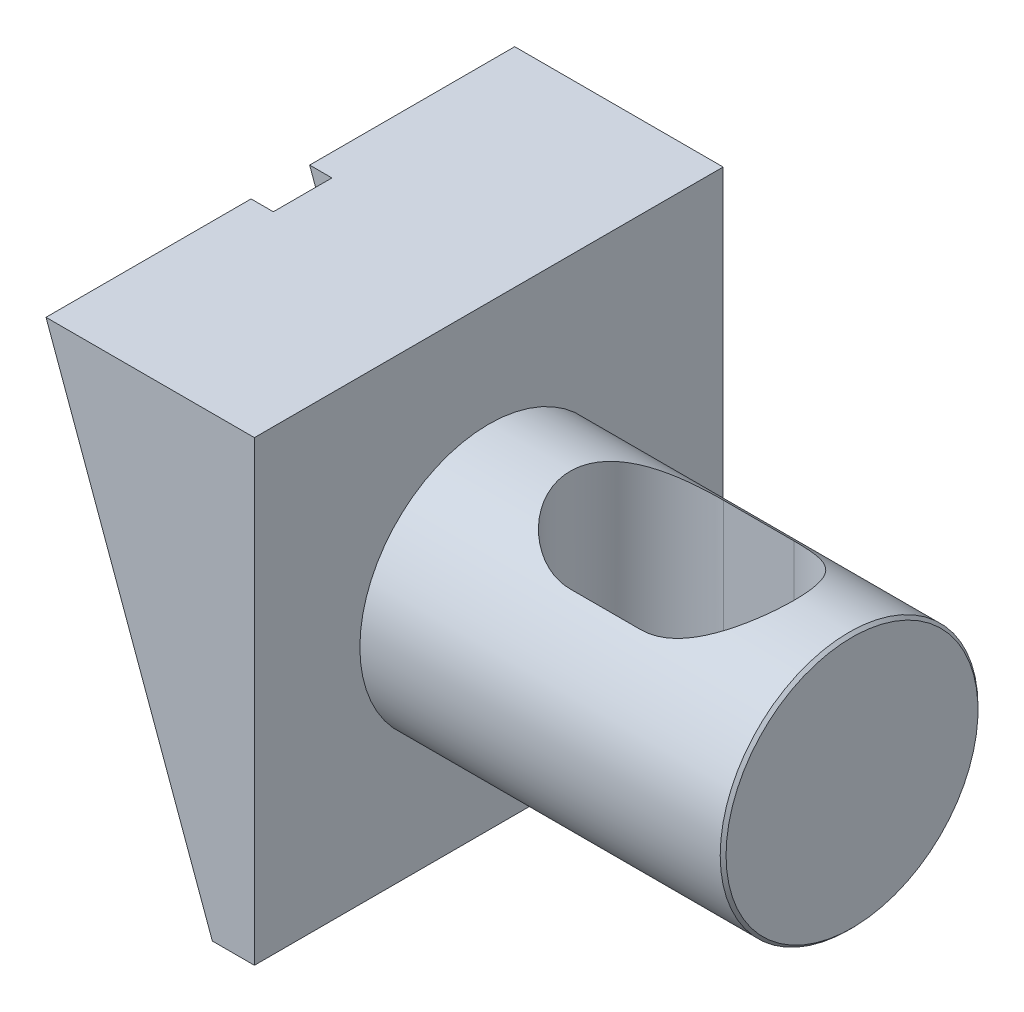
ISO-10303-21;
HEADER;
FILE_DESCRIPTION(('STEP AP214'),'2;1');
FILE_NAME('part.step','',(''),(''),'','','');
FILE_SCHEMA(('AUTOMOTIVE_DESIGN { 1 0 10303 214 1 1 1 1 }'));
ENDSEC;
DATA;
#1=APPLICATION_CONTEXT('core data for automotive mechanical design processes');
#2=APPLICATION_PROTOCOL_DEFINITION('international standard','automotive_design',2000,#1);
#3=PRODUCT_CONTEXT('',#1,'mechanical');
#4=PRODUCT('Part','Part','',(#3));
#5=PRODUCT_RELATED_PRODUCT_CATEGORY('part','',(#4));
#6=PRODUCT_DEFINITION_FORMATION('','',#4);
#7=PRODUCT_DEFINITION_CONTEXT('part definition',#1,'design');
#8=PRODUCT_DEFINITION('design','',#6,#7);
#9=PRODUCT_DEFINITION_SHAPE('','',#8);
#10=(LENGTH_UNIT() NAMED_UNIT(*) SI_UNIT(.MILLI.,.METRE.));
#11=(NAMED_UNIT(*) PLANE_ANGLE_UNIT() SI_UNIT($,.RADIAN.));
#12=(NAMED_UNIT(*) SI_UNIT($,.STERADIAN.) SOLID_ANGLE_UNIT());
#13=UNCERTAINTY_MEASURE_WITH_UNIT(LENGTH_MEASURE(1.E-05),#10,'distance_accuracy_value','');
#14=(GEOMETRIC_REPRESENTATION_CONTEXT(3) GLOBAL_UNCERTAINTY_ASSIGNED_CONTEXT((#13)) GLOBAL_UNIT_ASSIGNED_CONTEXT((#10,
#11,#12)) REPRESENTATION_CONTEXT('',''));
#15=CARTESIAN_POINT('',(0.,0.,0.));
#16=DIRECTION('',(0.,0.,1.));
#17=DIRECTION('',(1.,0.,0.));
#18=AXIS2_PLACEMENT_3D('',#15,#16,#17);
#19=CARTESIAN_POINT('',(-93.9,38.,0.));
#20=DIRECTION('',(1.,0.,0.));
#21=DIRECTION('',(0.,0.,-1.));
#22=AXIS2_PLACEMENT_3D('',#19,#20,#21);
#23=PLANE('',#22);
#24=CARTESIAN_POINT('',(-93.9,38.,0.));
#25=DIRECTION('',(-1.,0.,0.));
#26=DIRECTION('',(0.,0.,1.));
#27=AXIS2_PLACEMENT_3D('',#24,#25,#26);
#28=CIRCLE('',#27,10.);
#29=CARTESIAN_POINT('',(-93.9,38.,10.));
#30=VERTEX_POINT('',#29);
#31=EDGE_CURVE('E253',#30,#30,#28,.T.);
#32=ORIENTED_EDGE('',*,*,#31,.T.);
#33=EDGE_LOOP('',(#32));
#34=FACE_BOUND('',#33,.T.);
#35=CARTESIAN_POINT('',(-93.9,38.,0.));
#36=DIRECTION('',(1.,0.,0.));
#37=DIRECTION('',(0.,0.,-1.));
#38=AXIS2_PLACEMENT_3D('',#35,#36,#37);
#39=CIRCLE('',#38,3.);
#40=CARTESIAN_POINT('',(-93.9,38.,-3.));
#41=VERTEX_POINT('',#40);
#42=EDGE_CURVE('E11',#41,#41,#39,.F.);
#43=ORIENTED_EDGE('',*,*,#42,.F.);
#44=EDGE_LOOP('',(#43));
#45=FACE_BOUND('',#44,.T.);
#46=ADVANCED_FACE('F34',(#34,#45),#23,.F.);
#47=CARTESIAN_POINT('',(-68.9,51.,0.));
#48=DIRECTION('',(-1.,0.,0.));
#49=DIRECTION('',(0.,0.,1.));
#50=AXIS2_PLACEMENT_3D('',#47,#48,#49);
#51=PLANE('',#50);
#52=CARTESIAN_POINT('',(-68.9,38.,0.));
#53=DIRECTION('',(-1.,0.,0.));
#54=DIRECTION('',(0.,0.,1.));
#55=AXIS2_PLACEMENT_3D('',#52,#53,#54);
#56=CIRCLE('',#55,13.);
#57=CARTESIAN_POINT('',(-68.9,38.,13.));
#58=VERTEX_POINT('',#57);
#59=EDGE_CURVE('E256',#58,#58,#56,.T.);
#60=ORIENTED_EDGE('',*,*,#59,.T.);
#61=EDGE_LOOP('',(#60));
#62=FACE_BOUND('',#61,.T.);
#63=CARTESIAN_POINT('',(-68.9,38.,0.));
#64=DIRECTION('',(-1.,0.,0.));
#65=DIRECTION('',(0.,0.,1.));
#66=AXIS2_PLACEMENT_3D('',#63,#64,#65);
#67=CIRCLE('',#66,10.);
#68=CARTESIAN_POINT('',(-68.9,38.,10.));
#69=VERTEX_POINT('',#68);
#70=EDGE_CURVE('E250',#69,#69,#67,.T.);
#71=ORIENTED_EDGE('',*,*,#70,.F.);
#72=EDGE_LOOP('',(#71));
#73=FACE_BOUND('',#72,.T.);
#74=ADVANCED_FACE('F432',(#62,#73),#51,.T.);
#75=CARTESIAN_POINT('',(-97.572059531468,78.,40.));
#76=DIRECTION('',(0.939692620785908,0.342020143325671,0.));
#77=DIRECTION('',(-0.342020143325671,0.939692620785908,0.));
#78=AXIS2_PLACEMENT_3D('',#75,#76,#77);
#79=PLANE('',#78);
#80=CARTESIAN_POINT('',(-83.0132501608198,38.,0.));
#81=DIRECTION('',(0.939692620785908,0.342020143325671,0.));
#82=DIRECTION('',(-0.342020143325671,0.939692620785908,0.));
#83=AXIS2_PLACEMENT_3D('',#80,#81,#82);
#84=ELLIPSE('',#83,13.8343110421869,13.);
#85=CARTESIAN_POINT('',(-87.3808929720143,50.,-5.));
#86=VERTEX_POINT('',#85);
#87=CARTESIAN_POINT('',(-78.6456073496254,26.,-5.));
#88=VERTEX_POINT('',#87);
#89=EDGE_CURVE('E265',#86,#88,#84,.F.);
#90=ORIENTED_EDGE('',*,*,#89,.F.);
#91=DIRECTION('',(0.342020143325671,-0.939692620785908,0.));
#92=VECTOR('',#91,1.);
#93=CARTESIAN_POINT('',(-97.572059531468,78.,-5.));
#94=LINE('',#93,#92);
#95=CARTESIAN_POINT('',(-97.572059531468,78.,-5.));
#96=VERTEX_POINT('',#95);
#97=EDGE_CURVE('E292',#96,#86,#94,.T.);
#98=ORIENTED_EDGE('',*,*,#97,.F.);
#99=DIRECTION('',(0.,0.,-1.));
#100=VECTOR('',#99,1.);
#101=CARTESIAN_POINT('',(-97.572059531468,78.,40.));
#102=LINE('',#101,#100);
#103=CARTESIAN_POINT('',(-97.572059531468,78.,-40.));
#104=VERTEX_POINT('',#103);
#105=EDGE_CURVE('E339',#96,#104,#102,.T.);
#106=ORIENTED_EDGE('',*,*,#105,.T.);
#107=DIRECTION('',(0.342020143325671,-0.939692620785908,0.));
#108=VECTOR('',#107,1.);
#109=CARTESIAN_POINT('',(-97.572059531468,78.,-40.));
#110=LINE('',#109,#108);
#111=CARTESIAN_POINT('',(-69.182381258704,0.,-40.));
#112=VERTEX_POINT('',#111);
#113=EDGE_CURVE('E313',#104,#112,#110,.T.);
#114=ORIENTED_EDGE('',*,*,#113,.T.);
#115=DIRECTION('',(0.,0.,-1.));
#116=VECTOR('',#115,1.);
#117=CARTESIAN_POINT('',(-69.182381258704,0.,40.));
#118=LINE('',#117,#116);
#119=CARTESIAN_POINT('',(-69.182381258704,0.,-5.));
#120=VERTEX_POINT('',#119);
#121=EDGE_CURVE('E335',#120,#112,#118,.T.);
#122=ORIENTED_EDGE('',*,*,#121,.F.);
#123=EDGE_CURVE('E291',#88,#120,#94,.T.);
#124=ORIENTED_EDGE('',*,*,#123,.F.);
#125=EDGE_LOOP('',(#90,#98,#106,#114,#122,#124));
#126=FACE_BOUND('',#125,.T.);
#127=ADVANCED_FACE('F438',(#126),#79,.F.);
#128=CARTESIAN_POINT('',(-83.0132501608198,38.,0.));
#129=DIRECTION('',(0.939692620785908,0.342020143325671,0.));
#130=DIRECTION('',(-0.342020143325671,0.939692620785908,0.));
#131=AXIS2_PLACEMENT_3D('',#128,#129,#130);
#132=ELLIPSE('',#131,13.8343110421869,13.);
#133=CARTESIAN_POINT('',(-78.6456073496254,26.,5.));
#134=VERTEX_POINT('',#133);
#135=CARTESIAN_POINT('',(-87.3808929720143,50.,5.));
#136=VERTEX_POINT('',#135);
#137=EDGE_CURVE('E263',#134,#136,#132,.F.);
#138=ORIENTED_EDGE('',*,*,#137,.F.);
#139=DIRECTION('',(0.342020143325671,-0.939692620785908,0.));
#140=VECTOR('',#139,1.);
#141=CARTESIAN_POINT('',(-97.572059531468,78.,5.));
#142=LINE('',#141,#140);
#143=CARTESIAN_POINT('',(-69.182381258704,0.,5.));
#144=VERTEX_POINT('',#143);
#145=EDGE_CURVE('E295',#134,#144,#142,.T.);
#146=ORIENTED_EDGE('',*,*,#145,.T.);
#147=CARTESIAN_POINT('',(-69.182381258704,0.,40.));
#148=VERTEX_POINT('',#147);
#149=EDGE_CURVE('E336',#148,#144,#118,.T.);
#150=ORIENTED_EDGE('',*,*,#149,.F.);
#151=DIRECTION('',(0.342020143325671,-0.939692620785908,0.));
#152=VECTOR('',#151,1.);
#153=CARTESIAN_POINT('',(-97.572059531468,78.,40.));
#154=LINE('',#153,#152);
#155=CARTESIAN_POINT('',(-97.572059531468,78.,40.));
#156=VERTEX_POINT('',#155);
#157=EDGE_CURVE('E325',#156,#148,#154,.T.);
#158=ORIENTED_EDGE('',*,*,#157,.F.);
#159=CARTESIAN_POINT('',(-97.572059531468,78.,5.));
#160=VERTEX_POINT('',#159);
#161=EDGE_CURVE('E340',#156,#160,#102,.T.);
#162=ORIENTED_EDGE('',*,*,#161,.T.);
#163=EDGE_CURVE('E296',#160,#136,#142,.T.);
#164=ORIENTED_EDGE('',*,*,#163,.T.);
#165=EDGE_LOOP('',(#138,#146,#150,#158,#162,#164));
#166=FACE_BOUND('',#165,.T.);
#167=ADVANCED_FACE('F457',(#166),#79,.F.);
#168=CARTESIAN_POINT('',(-106.,0.,5.));
#169=DIRECTION('',(0.,0.,1.));
#170=DIRECTION('',(1.,0.,0.));
#171=AXIS2_PLACEMENT_3D('',#168,#169,#170);
#172=PLANE('',#171);
#173=DIRECTION('',(-1.,0.,0.));
#174=VECTOR('',#173,1.);
#175=CARTESIAN_POINT('',(-68.9,50.,5.));
#176=LINE('',#175,#174);
#177=CARTESIAN_POINT('',(-83.5808929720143,50.,5.));
#178=VERTEX_POINT('',#177);
#179=EDGE_CURVE('E58',#136,#178,#176,.F.);
#180=ORIENTED_EDGE('',*,*,#179,.F.);
#181=ORIENTED_EDGE('',*,*,#163,.F.);
#182=DIRECTION('',(-1.,0.,0.));
#183=VECTOR('',#182,1.);
#184=CARTESIAN_POINT('',(-93.772059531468,78.,5.));
#185=LINE('',#184,#183);
#186=CARTESIAN_POINT('',(-93.772059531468,78.,5.));
#187=VERTEX_POINT('',#186);
#188=EDGE_CURVE('E282',#187,#160,#185,.T.);
#189=ORIENTED_EDGE('',*,*,#188,.F.);
#190=DIRECTION('',(-0.342020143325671,0.939692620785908,0.));
#191=VECTOR('',#190,1.);
#192=CARTESIAN_POINT('',(-65.382381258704,0.,5.));
#193=LINE('',#192,#191);
#194=EDGE_CURVE('E278',#178,#187,#193,.T.);
#195=ORIENTED_EDGE('',*,*,#194,.F.);
#196=EDGE_LOOP('',(#180,#181,#189,#195));
#197=FACE_BOUND('',#196,.T.);
#198=ADVANCED_FACE('F455',(#197),#172,.F.);
#199=DIRECTION('',(-1.,0.,0.));
#200=VECTOR('',#199,1.);
#201=CARTESIAN_POINT('',(-68.9,26.,5.));
#202=LINE('',#201,#200);
#203=CARTESIAN_POINT('',(-74.8456073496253,26.,5.));
#204=VERTEX_POINT('',#203);
#205=EDGE_CURVE('E270',#204,#134,#202,.T.);
#206=ORIENTED_EDGE('',*,*,#205,.F.);
#207=CARTESIAN_POINT('',(-65.382381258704,0.,5.));
#208=VERTEX_POINT('',#207);
#209=EDGE_CURVE('E279',#208,#204,#193,.T.);
#210=ORIENTED_EDGE('',*,*,#209,.F.);
#211=DIRECTION('',(1.,0.,0.));
#212=VECTOR('',#211,1.);
#213=CARTESIAN_POINT('',(-69.182381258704,0.,5.));
#214=LINE('',#213,#212);
#215=EDGE_CURVE('E473',#144,#208,#214,.T.);
#216=ORIENTED_EDGE('',*,*,#215,.F.);
#217=ORIENTED_EDGE('',*,*,#145,.F.);
#218=EDGE_LOOP('',(#206,#210,#216,#217));
#219=FACE_BOUND('',#218,.T.);
#220=ADVANCED_FACE('F453',(#219),#172,.F.);
#221=CARTESIAN_POINT('',(-106.,0.,-5.));
#222=DIRECTION('',(0.,0.,1.));
#223=DIRECTION('',(1.,0.,0.));
#224=AXIS2_PLACEMENT_3D('',#221,#222,#223);
#225=PLANE('',#224);
#226=ORIENTED_EDGE('',*,*,#97,.T.);
#227=DIRECTION('',(-1.,0.,0.));
#228=VECTOR('',#227,1.);
#229=CARTESIAN_POINT('',(-68.9,50.,-5.));
#230=LINE('',#229,#228);
#231=CARTESIAN_POINT('',(-83.5808929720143,50.,-5.));
#232=VERTEX_POINT('',#231);
#233=EDGE_CURVE('E259',#86,#232,#230,.F.);
#234=ORIENTED_EDGE('',*,*,#233,.T.);
#235=DIRECTION('',(-0.342020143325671,0.939692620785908,0.));
#236=VECTOR('',#235,1.);
#237=CARTESIAN_POINT('',(-65.382381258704,0.,-5.));
#238=LINE('',#237,#236);
#239=CARTESIAN_POINT('',(-93.772059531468,78.,-5.));
#240=VERTEX_POINT('',#239);
#241=EDGE_CURVE('E272',#232,#240,#238,.T.);
#242=ORIENTED_EDGE('',*,*,#241,.T.);
#243=DIRECTION('',(-1.,0.,0.));
#244=VECTOR('',#243,1.);
#245=CARTESIAN_POINT('',(-93.772059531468,78.,-5.));
#246=LINE('',#245,#244);
#247=EDGE_CURVE('E276',#240,#96,#246,.T.);
#248=ORIENTED_EDGE('',*,*,#247,.T.);
#249=EDGE_LOOP('',(#226,#234,#242,#248));
#250=FACE_BOUND('',#249,.T.);
#251=ADVANCED_FACE('F449',(#250),#225,.T.);
#252=CARTESIAN_POINT('',(-65.382381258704,0.,-5.));
#253=VERTEX_POINT('',#252);
#254=CARTESIAN_POINT('',(-74.8456073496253,26.,-5.));
#255=VERTEX_POINT('',#254);
#256=EDGE_CURVE('E273',#253,#255,#238,.T.);
#257=ORIENTED_EDGE('',*,*,#256,.T.);
#258=DIRECTION('',(-1.,0.,0.));
#259=VECTOR('',#258,1.);
#260=CARTESIAN_POINT('',(-68.9,26.,-5.));
#261=LINE('',#260,#259);
#262=EDGE_CURVE('E267',#255,#88,#261,.T.);
#263=ORIENTED_EDGE('',*,*,#262,.T.);
#264=ORIENTED_EDGE('',*,*,#123,.T.);
#265=DIRECTION('',(1.,0.,0.));
#266=VECTOR('',#265,1.);
#267=CARTESIAN_POINT('',(-69.182381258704,0.,-5.));
#268=LINE('',#267,#266);
#269=EDGE_CURVE('E389',#120,#253,#268,.T.);
#270=ORIENTED_EDGE('',*,*,#269,.T.);
#271=EDGE_LOOP('',(#257,#263,#264,#270));
#272=FACE_BOUND('',#271,.T.);
#273=ADVANCED_FACE('F452',(#272),#225,.T.);
#274=CARTESIAN_POINT('',(-65.382381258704,0.,5.));
#275=DIRECTION('',(-0.939692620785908,-0.342020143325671,0.));
#276=DIRECTION('',(0.342020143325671,-0.939692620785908,0.));
#277=AXIS2_PLACEMENT_3D('',#274,#275,#276);
#278=PLANE('',#277);
#279=ORIENTED_EDGE('',*,*,#209,.T.);
#280=CARTESIAN_POINT('',(-79.2132501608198,38.,0.));
#281=DIRECTION('',(-0.939692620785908,-0.342020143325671,0.));
#282=DIRECTION('',(-0.342020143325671,0.939692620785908,0.));
#283=AXIS2_PLACEMENT_3D('',#280,#281,#282);
#284=ELLIPSE('',#283,13.8343110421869,13.);
#285=EDGE_CURVE('E43',#204,#255,#284,.F.);
#286=ORIENTED_EDGE('',*,*,#285,.T.);
#287=ORIENTED_EDGE('',*,*,#256,.F.);
#288=DIRECTION('',(0.,0.,-1.));
#289=VECTOR('',#288,1.);
#290=CARTESIAN_POINT('',(-65.382381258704,0.,5.));
#291=LINE('',#290,#289);
#292=EDGE_CURVE('E288',#208,#253,#291,.T.);
#293=ORIENTED_EDGE('',*,*,#292,.F.);
#294=EDGE_LOOP('',(#279,#286,#287,#293));
#295=FACE_BOUND('',#294,.T.);
#296=ADVANCED_FACE('F429',(#295),#278,.T.);
#297=ORIENTED_EDGE('',*,*,#241,.F.);
#298=EDGE_CURVE('E479',#232,#178,#284,.F.);
#299=ORIENTED_EDGE('',*,*,#298,.T.);
#300=ORIENTED_EDGE('',*,*,#194,.T.);
#301=DIRECTION('',(0.,0.,-1.));
#302=VECTOR('',#301,1.);
#303=CARTESIAN_POINT('',(-93.772059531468,78.,5.));
#304=LINE('',#303,#302);
#305=EDGE_CURVE('E285',#187,#240,#304,.T.);
#306=ORIENTED_EDGE('',*,*,#305,.T.);
#307=EDGE_LOOP('',(#297,#299,#300,#306));
#308=FACE_BOUND('',#307,.T.);
#309=ADVANCED_FACE('F422',(#308),#278,.T.);
#310=CARTESIAN_POINT('',(0.,38.,0.));
#311=DIRECTION('',(-1.,0.,0.));
#312=DIRECTION('',(0.,0.,1.));
#313=AXIS2_PLACEMENT_3D('',#310,#311,#312);
#314=CYLINDRICAL_SURFACE('',#313,22.);
#315=CARTESIAN_POINT('',(-35.,20.3254420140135,13.1));
#316=CARTESIAN_POINT('',(-35.1659479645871,20.3254476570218,13.1000019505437));
#317=CARTESIAN_POINT('',(-35.3318704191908,20.3231037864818,13.0968459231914));
#318=CARTESIAN_POINT('',(-35.6633346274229,20.313773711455,13.0842458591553));
#319=CARTESIAN_POINT('',(-35.8288764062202,20.3067878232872,13.0748022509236));
#320=CARTESIAN_POINT('',(-36.3240745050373,20.2789739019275,13.0371114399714));
#321=CARTESIAN_POINT('',(-36.6527025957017,20.2512893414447,12.9995041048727));
#322=CARTESIAN_POINT('',(-37.3016814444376,20.1791007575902,12.900357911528));
#323=CARTESIAN_POINT('',(-37.6220770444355,20.1347311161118,12.8390101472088));
#324=CARTESIAN_POINT('',(-38.2551318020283,20.0309057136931,12.6932912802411));
#325=CARTESIAN_POINT('',(-38.5677894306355,19.9714469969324,12.60891566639));
#326=CARTESIAN_POINT('',(-39.1823804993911,19.8398098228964,12.4185665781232));
#327=CARTESIAN_POINT('',(-39.4843489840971,19.7676786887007,12.3126732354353));
#328=CARTESIAN_POINT('',(-40.0773069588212,19.6128556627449,12.080250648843));
#329=CARTESIAN_POINT('',(-40.3682967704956,19.5301640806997,11.9537220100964));
#330=CARTESIAN_POINT('',(-41.224561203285,19.2692957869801,11.5440612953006));
#331=CARTESIAN_POINT('',(-41.772207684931,19.0785353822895,11.2311441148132));
#332=CARTESIAN_POINT('',(-42.5835146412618,18.7691101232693,10.6875388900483));
#333=CARTESIAN_POINT('',(-42.8661164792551,18.6556486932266,10.4812392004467));
#334=CARTESIAN_POINT('',(-43.4135427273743,18.4266521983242,10.0470996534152));
#335=CARTESIAN_POINT('',(-43.678365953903,18.3111169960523,9.81925836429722));
#336=CARTESIAN_POINT('',(-44.189241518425,18.0806591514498,9.34290756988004));
#337=CARTESIAN_POINT('',(-44.4352845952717,17.9657368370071,9.09438799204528));
#338=CARTESIAN_POINT('',(-44.9073077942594,17.7391532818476,8.57774033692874));
#339=CARTESIAN_POINT('',(-45.1332942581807,17.6274910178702,8.30961850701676));
#340=CARTESIAN_POINT('',(-45.5869809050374,17.3982559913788,7.72508110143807));
#341=CARTESIAN_POINT('',(-45.8123037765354,17.2813189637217,7.40656270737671));
#342=CARTESIAN_POINT('',(-46.2350551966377,17.0575956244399,6.74808184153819));
#343=CARTESIAN_POINT('',(-46.4324812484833,16.9508102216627,6.40811745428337));
#344=CARTESIAN_POINT('',(-46.7971916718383,16.7505171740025,5.70890759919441));
#345=CARTESIAN_POINT('',(-46.9644951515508,16.6570011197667,5.34967454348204));
#346=CARTESIAN_POINT('',(-47.2669013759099,16.4860207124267,4.61423143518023));
#347=CARTESIAN_POINT('',(-47.4020093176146,16.408553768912,4.23802413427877));
#348=CARTESIAN_POINT('',(-47.6268164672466,16.2786070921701,3.50789771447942));
#349=CARTESIAN_POINT('',(-47.7195966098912,16.2244597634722,3.15522306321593));
#350=CARTESIAN_POINT('',(-47.8757020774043,16.1329083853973,2.44126557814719));
#351=CARTESIAN_POINT('',(-47.9390290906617,16.095503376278,2.07998323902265));
#352=CARTESIAN_POINT('',(-48.0351828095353,16.0385681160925,1.35226328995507));
#353=CARTESIAN_POINT('',(-48.0680328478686,16.0190241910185,0.985829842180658));
#354=CARTESIAN_POINT('',(-48.1027575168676,15.9983625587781,0.250993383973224));
#355=CARTESIAN_POINT('',(-48.1046352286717,15.997243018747,-0.117409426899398));
#356=CARTESIAN_POINT('',(-48.0790683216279,16.01245893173,-0.807619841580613));
#357=CARTESIAN_POINT('',(-48.0551830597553,16.0266755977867,-1.12961373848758));
#358=CARTESIAN_POINT('',(-47.9838654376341,16.0689732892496,-1.77003337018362));
#359=CARTESIAN_POINT('',(-47.9364354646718,16.0970529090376,-2.08845946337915));
#360=CARTESIAN_POINT('',(-47.8186204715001,16.1664302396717,-2.71956442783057));
#361=CARTESIAN_POINT('',(-47.7482347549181,16.2077283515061,-3.03224312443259));
#362=CARTESIAN_POINT('',(-47.5853281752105,16.3026244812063,-3.6498665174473));
#363=CARTESIAN_POINT('',(-47.492806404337,16.3562230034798,-3.95481089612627));
#364=CARTESIAN_POINT('',(-47.2859657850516,16.4749508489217,-4.55708976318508));
#365=CARTESIAN_POINT('',(-47.1715143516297,16.5401501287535,-4.85436479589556));
#366=CARTESIAN_POINT('',(-46.9222863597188,16.6805180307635,-5.43780539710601));
#367=CARTESIAN_POINT('',(-46.787509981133,16.7556865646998,-5.72397106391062));
#368=CARTESIAN_POINT('',(-46.4987547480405,16.9145352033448,-6.2839377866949));
#369=CARTESIAN_POINT('',(-46.3447772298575,16.9982147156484,-6.55773970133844));
#370=CARTESIAN_POINT('',(-46.0186300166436,17.1725851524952,-7.09209606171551));
#371=CARTESIAN_POINT('',(-45.8464523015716,17.2632791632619,-7.35264459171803));
#372=CARTESIAN_POINT('',(-45.4635670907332,17.4611034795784,-7.88954784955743));
#373=CARTESIAN_POINT('',(-45.2507112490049,17.5689086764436,-8.16412364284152));
#374=CARTESIAN_POINT('',(-44.8049441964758,17.7888803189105,-8.69442566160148));
#375=CARTESIAN_POINT('',(-44.5720388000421,17.9010454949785,-8.95015731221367));
#376=CARTESIAN_POINT('',(-44.086833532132,18.1275457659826,-9.4424086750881));
#377=CARTESIAN_POINT('',(-43.8345017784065,18.241884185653,-9.67889543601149));
#378=CARTESIAN_POINT('',(-43.3118056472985,18.4700023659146,-10.131307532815));
#379=CARTESIAN_POINT('',(-43.041440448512,18.5837821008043,-10.3472319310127));
#380=CARTESIAN_POINT('',(-42.4516643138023,18.8209403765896,-10.7810727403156));
#381=CARTESIAN_POINT('',(-42.1301781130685,18.9439315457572,-10.9964015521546));
#382=CARTESIAN_POINT('',(-41.6330706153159,19.1224016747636,-11.2982285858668));
#383=CARTESIAN_POINT('',(-41.4648712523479,19.1808943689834,-11.3953183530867));
#384=CARTESIAN_POINT('',(-41.1235873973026,19.2953892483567,-11.5822948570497));
#385=CARTESIAN_POINT('',(-40.9505008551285,19.3513903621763,-11.6721785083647));
#386=CARTESIAN_POINT('',(-40.4254806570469,19.5144532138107,-11.9300389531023));
#387=CARTESIAN_POINT('',(-40.0665967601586,19.6170081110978,-12.0869489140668));
#388=CARTESIAN_POINT('',(-39.3325086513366,19.8056330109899,-12.369069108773));
#389=CARTESIAN_POINT('',(-38.9573108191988,19.8917093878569,-12.4942916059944));
#390=CARTESIAN_POINT('',(-38.2892363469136,20.0241716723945,-12.683823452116));
#391=CARTESIAN_POINT('',(-37.9993446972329,20.0750966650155,-12.7555326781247));
#392=CARTESIAN_POINT('',(-37.4134723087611,20.1637709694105,-12.8792369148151));
#393=CARTESIAN_POINT('',(-37.1174935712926,20.2015245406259,-12.9312382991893));
#394=CARTESIAN_POINT('',(-36.5192013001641,20.2627814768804,-13.0151382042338));
#395=CARTESIAN_POINT('',(-36.2168591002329,20.2861906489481,-13.0469038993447));
#396=CARTESIAN_POINT('',(-35.7615837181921,20.3096932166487,-13.0787306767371));
#397=CARTESIAN_POINT('',(-35.6094491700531,20.31559225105,-13.0867026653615));
#398=CARTESIAN_POINT('',(-35.3048829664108,20.323468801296,-13.0973382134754));
#399=CARTESIAN_POINT('',(-35.1524512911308,20.3254460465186,-13.1000014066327));
#400=CARTESIAN_POINT('',(-35.,20.3254420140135,-13.1));
#401=B_SPLINE_CURVE_WITH_KNOTS('',3,(#315,#316,#317,#318,#319,#320,#321,#322,#323,#324,#325,
#326,#327,#328,#329,#330,#331,#332,#333,#334,#335,#336,#337,#338,#339,#340,#341,#342,#343,#344,
#345,#346,#347,#348,#349,#350,#351,#352,#353,#354,#355,#356,#357,#358,#359,#360,#361,#362,#363,
#364,#365,#366,#367,#368,#369,#370,#371,#372,#373,#374,#375,#376,#377,#378,#379,#380,#381,#382,
#383,#384,#385,#386,#387,#388,#389,#390,#391,#392,#393,#394,#395,#396,#397,#398,#399,#400),
.UNSPECIFIED.,.F.,.F.,(4,2,2,2,2,2,2,2,2,2,2,2,2,2,2,2,2,2,2,2,2,2,2,2,2,2,2,2,2,2,2,2,2,2,2,2,
2,2,2,2,2,2,4),(0.,0.497747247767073,0.995460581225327,1.98969502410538,2.97608767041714,
3.96267369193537,4.94565088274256,5.92859925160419,7.89743668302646,9.00010381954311,
10.1028442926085,11.20612509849,12.3090558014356,13.5293684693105,14.7497902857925,
15.9694351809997,17.1888830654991,18.2933163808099,19.3976863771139,20.5012101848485,
21.6046242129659,22.5730401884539,23.5413579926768,24.509705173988,25.4780920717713,
26.4525298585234,27.4269590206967,28.4013204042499,29.376112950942,30.4662757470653,
31.5561234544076,32.6477995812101,33.7395254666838,34.9559051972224,35.5642139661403,
36.1727818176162,37.3855583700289,38.597864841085,39.5057707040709,40.4133826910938,
41.3268924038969,41.7841400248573,42.241419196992),.UNSPECIFIED.);
#402=CARTESIAN_POINT('',(-35.,20.3254420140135,13.1));
#403=VERTEX_POINT('',#402);
#404=CARTESIAN_POINT('',(-35.,20.3254420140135,-13.1));
#405=VERTEX_POINT('',#404);
#406=EDGE_CURVE('E399',#403,#405,#401,.T.);
#407=ORIENTED_EDGE('',*,*,#406,.F.);
#408=DIRECTION('',(-1.,0.,0.));
#409=VECTOR('',#408,1.);
#410=CARTESIAN_POINT('',(0.,20.3254420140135,13.1));
#411=LINE('',#410,#409);
#412=CARTESIAN_POINT('',(-23.,20.3254420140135,13.1));
#413=VERTEX_POINT('',#412);
#414=EDGE_CURVE('E360',#413,#403,#411,.T.);
#415=ORIENTED_EDGE('',*,*,#414,.F.);
#416=CARTESIAN_POINT('',(-23.,20.3254420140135,-13.1));
#417=CARTESIAN_POINT('',(-22.8340520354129,20.3254476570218,-13.1000019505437));
#418=CARTESIAN_POINT('',(-22.6681295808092,20.3231037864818,-13.0968459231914));
#419=CARTESIAN_POINT('',(-22.3366653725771,20.313773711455,-13.0842458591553));
#420=CARTESIAN_POINT('',(-22.1711235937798,20.3067878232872,-13.0748022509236));
#421=CARTESIAN_POINT('',(-21.6759254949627,20.2789739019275,-13.0371114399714));
#422=CARTESIAN_POINT('',(-21.3472974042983,20.2512893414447,-12.9995041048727));
#423=CARTESIAN_POINT('',(-20.6983185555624,20.1791007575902,-12.900357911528));
#424=CARTESIAN_POINT('',(-20.3779229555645,20.1347311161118,-12.8390101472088));
#425=CARTESIAN_POINT('',(-19.7448681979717,20.0309057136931,-12.6932912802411));
#426=CARTESIAN_POINT('',(-19.4322105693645,19.9714469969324,-12.60891566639));
#427=CARTESIAN_POINT('',(-18.8176195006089,19.8398098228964,-12.4185665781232));
#428=CARTESIAN_POINT('',(-18.5156510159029,19.7676786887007,-12.3126732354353));
#429=CARTESIAN_POINT('',(-17.9226930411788,19.6128556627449,-12.080250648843));
#430=CARTESIAN_POINT('',(-17.6317032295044,19.5301640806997,-11.9537220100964));
#431=CARTESIAN_POINT('',(-16.775438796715,19.2692957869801,-11.5440612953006));
#432=CARTESIAN_POINT('',(-16.227792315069,19.0785353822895,-11.2311441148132));
#433=CARTESIAN_POINT('',(-15.4164853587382,18.7691101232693,-10.6875388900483));
#434=CARTESIAN_POINT('',(-15.1338835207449,18.6556486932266,-10.4812392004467));
#435=CARTESIAN_POINT('',(-14.5864572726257,18.4266521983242,-10.0470996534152));
#436=CARTESIAN_POINT('',(-14.321634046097,18.3111169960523,-9.81925836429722));
#437=CARTESIAN_POINT('',(-13.810758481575,18.0806591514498,-9.34290756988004));
#438=CARTESIAN_POINT('',(-13.5647154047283,17.9657368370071,-9.09438799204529));
#439=CARTESIAN_POINT('',(-13.0926922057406,17.7391532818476,-8.57774033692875));
#440=CARTESIAN_POINT('',(-12.8667057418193,17.6274910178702,-8.30961850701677));
#441=CARTESIAN_POINT('',(-12.4130190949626,17.3982559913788,-7.72508110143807));
#442=CARTESIAN_POINT('',(-12.1876962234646,17.2813189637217,-7.40656270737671));
#443=CARTESIAN_POINT('',(-11.7649448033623,17.0575956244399,-6.74808184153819));
#444=CARTESIAN_POINT('',(-11.5675187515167,16.9508102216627,-6.40811745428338));
#445=CARTESIAN_POINT('',(-11.2028083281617,16.7505171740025,-5.70890759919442));
#446=CARTESIAN_POINT('',(-11.0355048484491,16.6570011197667,-5.34967454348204));
#447=CARTESIAN_POINT('',(-10.7330986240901,16.4860207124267,-4.61423143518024));
#448=CARTESIAN_POINT('',(-10.5979906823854,16.408553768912,-4.23802413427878));
#449=CARTESIAN_POINT('',(-10.3731835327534,16.2786070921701,-3.50789771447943));
#450=CARTESIAN_POINT('',(-10.2804033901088,16.2244597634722,-3.15522306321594));
#451=CARTESIAN_POINT('',(-10.1242979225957,16.1329083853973,-2.44126557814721));
#452=CARTESIAN_POINT('',(-10.0609709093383,16.095503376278,-2.07998323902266));
#453=CARTESIAN_POINT('',(-9.96481719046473,16.0385681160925,-1.35226328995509));
#454=CARTESIAN_POINT('',(-9.93196715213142,16.0190241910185,-0.98582984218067));
#455=CARTESIAN_POINT('',(-9.8972424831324,15.9983625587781,-0.250993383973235));
#456=CARTESIAN_POINT('',(-9.89536477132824,15.997243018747,0.117409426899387));
#457=CARTESIAN_POINT('',(-9.92093167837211,16.01245893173,0.807619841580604));
#458=CARTESIAN_POINT('',(-9.94481694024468,16.0266755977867,1.12961373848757));
#459=CARTESIAN_POINT('',(-10.0161345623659,16.0689732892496,1.77003337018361));
#460=CARTESIAN_POINT('',(-10.0635645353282,16.0970529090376,2.08845946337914));
#461=CARTESIAN_POINT('',(-10.1813795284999,16.1664302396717,2.71956442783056));
#462=CARTESIAN_POINT('',(-10.2517652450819,16.2077283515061,3.03224312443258));
#463=CARTESIAN_POINT('',(-10.4146718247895,16.3026244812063,3.64986651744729));
#464=CARTESIAN_POINT('',(-10.507193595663,16.3562230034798,3.95481089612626));
#465=CARTESIAN_POINT('',(-10.7140342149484,16.4749508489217,4.55708976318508));
#466=CARTESIAN_POINT('',(-10.8284856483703,16.5401501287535,4.85436479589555));
#467=CARTESIAN_POINT('',(-11.0777136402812,16.6805180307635,5.437805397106));
#468=CARTESIAN_POINT('',(-11.212490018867,16.7556865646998,5.72397106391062));
#469=CARTESIAN_POINT('',(-11.5012452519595,16.9145352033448,6.28393778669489));
#470=CARTESIAN_POINT('',(-11.6552227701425,16.9982147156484,6.55773970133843));
#471=CARTESIAN_POINT('',(-11.9813699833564,17.1725851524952,7.0920960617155));
#472=CARTESIAN_POINT('',(-12.1535476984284,17.2632791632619,7.35264459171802));
#473=CARTESIAN_POINT('',(-12.5364329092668,17.4611034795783,7.88954784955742));
#474=CARTESIAN_POINT('',(-12.7492887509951,17.5689086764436,8.16412364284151));
#475=CARTESIAN_POINT('',(-13.1950558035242,17.7888803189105,8.69442566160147));
#476=CARTESIAN_POINT('',(-13.4279611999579,17.9010454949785,8.95015731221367));
#477=CARTESIAN_POINT('',(-13.913166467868,18.1275457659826,9.4424086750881));
#478=CARTESIAN_POINT('',(-14.1654982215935,18.241884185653,9.67889543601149));
#479=CARTESIAN_POINT('',(-14.6881943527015,18.4700023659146,10.131307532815));
#480=CARTESIAN_POINT('',(-14.958559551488,18.5837821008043,10.3472319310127));
#481=CARTESIAN_POINT('',(-15.5483356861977,18.8209403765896,10.7810727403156));
#482=CARTESIAN_POINT('',(-15.8698218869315,18.9439315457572,10.9964015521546));
#483=CARTESIAN_POINT('',(-16.3669293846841,19.1224016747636,11.2982285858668));
#484=CARTESIAN_POINT('',(-16.5351287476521,19.1808943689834,11.3953183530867));
#485=CARTESIAN_POINT('',(-16.8764126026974,19.2953892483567,11.5822948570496));
#486=CARTESIAN_POINT('',(-17.0494991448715,19.3513903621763,11.6721785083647));
#487=CARTESIAN_POINT('',(-17.5745193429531,19.5144532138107,11.9300389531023));
#488=CARTESIAN_POINT('',(-17.9334032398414,19.6170081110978,12.0869489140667));
#489=CARTESIAN_POINT('',(-18.6674913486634,19.8056330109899,12.3690691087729));
#490=CARTESIAN_POINT('',(-19.0426891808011,19.8917093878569,12.4942916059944));
#491=CARTESIAN_POINT('',(-19.7107636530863,20.0241716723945,12.683823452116));
#492=CARTESIAN_POINT('',(-20.0006553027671,20.0750966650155,12.7555326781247));
#493=CARTESIAN_POINT('',(-20.5865276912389,20.1637709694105,12.8792369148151));
#494=CARTESIAN_POINT('',(-20.8825064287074,20.2015245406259,12.9312382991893));
#495=CARTESIAN_POINT('',(-21.4807986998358,20.2627814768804,13.0151382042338));
#496=CARTESIAN_POINT('',(-21.7831408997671,20.2861906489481,13.0469038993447));
#497=CARTESIAN_POINT('',(-22.2384162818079,20.3096932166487,13.0787306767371));
#498=CARTESIAN_POINT('',(-22.3905508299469,20.31559225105,13.0867026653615));
#499=CARTESIAN_POINT('',(-22.6951170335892,20.323468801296,13.0973382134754));
#500=CARTESIAN_POINT('',(-22.8475487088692,20.3254460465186,13.1000014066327));
#501=CARTESIAN_POINT('',(-23.,20.3254420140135,13.1));
#502=B_SPLINE_CURVE_WITH_KNOTS('',3,(#416,#417,#418,#419,#420,#421,#422,#423,#424,#425,#426,
#427,#428,#429,#430,#431,#432,#433,#434,#435,#436,#437,#438,#439,#440,#441,#442,#443,#444,#445,
#446,#447,#448,#449,#450,#451,#452,#453,#454,#455,#456,#457,#458,#459,#460,#461,#462,#463,#464,
#465,#466,#467,#468,#469,#470,#471,#472,#473,#474,#475,#476,#477,#478,#479,#480,#481,#482,#483,
#484,#485,#486,#487,#488,#489,#490,#491,#492,#493,#494,#495,#496,#497,#498,#499,#500,#501),
.UNSPECIFIED.,.F.,.F.,(4,2,2,2,2,2,2,2,2,2,2,2,2,2,2,2,2,2,2,2,2,2,2,2,2,2,2,2,2,2,2,2,2,2,2,2,
2,2,2,2,2,2,4),(0.,0.497747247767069,0.99546058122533,1.98969502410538,2.97608767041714,
3.96267369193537,4.94565088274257,5.92859925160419,7.89743668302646,9.00010381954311,
10.1028442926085,11.20612509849,12.3090558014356,13.5293684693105,14.7497902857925,
15.9694351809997,17.1888830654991,18.2933163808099,19.3976863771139,20.5012101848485,
21.6046242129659,22.5730401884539,23.5413579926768,24.509705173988,25.4780920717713,
26.4525298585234,27.4269590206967,28.4013204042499,29.376112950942,30.4662757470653,
31.5561234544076,32.6477995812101,33.7395254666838,34.9559051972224,35.5642139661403,
36.1727818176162,37.3855583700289,38.597864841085,39.5057707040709,40.4133826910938,
41.3268924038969,41.7841400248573,42.241419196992),.UNSPECIFIED.);
#503=CARTESIAN_POINT('',(-23.,20.3254420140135,-13.1));
#504=VERTEX_POINT('',#503);
#505=EDGE_CURVE('E354',#504,#413,#502,.T.);
#506=ORIENTED_EDGE('',*,*,#505,.F.);
#507=DIRECTION('',(-1.,0.,0.));
#508=VECTOR('',#507,1.);
#509=CARTESIAN_POINT('',(0.,20.3254420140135,-13.1));
#510=LINE('',#509,#508);
#511=EDGE_CURVE('E352',#405,#504,#510,.F.);
#512=ORIENTED_EDGE('',*,*,#511,.F.);
#513=EDGE_LOOP('',(#407,#415,#506,#512));
#514=FACE_BOUND('',#513,.T.);
#515=CARTESIAN_POINT('',(-62.,38.,0.));
#516=DIRECTION('',(-1.,0.,0.));
#517=DIRECTION('',(0.,0.,1.));
#518=AXIS2_PLACEMENT_3D('',#515,#516,#517);
#519=CIRCLE('',#518,22.);
#520=CARTESIAN_POINT('',(-62.,38.,22.));
#521=VERTEX_POINT('',#520);
#522=EDGE_CURVE('E349',#521,#521,#519,.T.);
#523=ORIENTED_EDGE('',*,*,#522,.F.);
#524=EDGE_LOOP('',(#523));
#525=FACE_BOUND('',#524,.T.);
#526=CARTESIAN_POINT('',(-0.5,38.,0.));
#527=DIRECTION('',(-1.,0.,0.));
#528=DIRECTION('',(0.,0.,1.));
#529=AXIS2_PLACEMENT_3D('',#526,#527,#528);
#530=CIRCLE('',#529,22.);
#531=CARTESIAN_POINT('',(-0.5,38.,22.));
#532=VERTEX_POINT('',#531);
#533=EDGE_CURVE('E346',#532,#532,#530,.T.);
#534=ORIENTED_EDGE('',*,*,#533,.T.);
#535=EDGE_LOOP('',(#534));
#536=FACE_BOUND('',#535,.T.);
#537=CARTESIAN_POINT('',(-35.,55.6745579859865,-13.1));
#538=CARTESIAN_POINT('',(-35.1659479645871,55.6745523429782,-13.1000019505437));
#539=CARTESIAN_POINT('',(-35.3318704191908,55.6768962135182,-13.0968459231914));
#540=CARTESIAN_POINT('',(-35.6633346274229,55.686226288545,-13.0842458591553));
#541=CARTESIAN_POINT('',(-35.8288764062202,55.6932121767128,-13.0748022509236));
#542=CARTESIAN_POINT('',(-36.3240745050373,55.7210260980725,-13.0371114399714));
#543=CARTESIAN_POINT('',(-36.6527025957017,55.7487106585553,-12.9995041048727));
#544=CARTESIAN_POINT('',(-37.3016814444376,55.8208992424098,-12.900357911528));
#545=CARTESIAN_POINT('',(-37.6220770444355,55.8652688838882,-12.8390101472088));
#546=CARTESIAN_POINT('',(-38.2551318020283,55.9690942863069,-12.6932912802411));
#547=CARTESIAN_POINT('',(-38.5677894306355,56.0285530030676,-12.60891566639));
#548=CARTESIAN_POINT('',(-39.1823804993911,56.1601901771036,-12.4185665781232));
#549=CARTESIAN_POINT('',(-39.4843489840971,56.2323213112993,-12.3126732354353));
#550=CARTESIAN_POINT('',(-40.0773069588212,56.3871443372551,-12.080250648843));
#551=CARTESIAN_POINT('',(-40.3682967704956,56.4698359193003,-11.9537220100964));
#552=CARTESIAN_POINT('',(-41.224561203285,56.7307042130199,-11.5440612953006));
#553=CARTESIAN_POINT('',(-41.772207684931,56.9214646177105,-11.2311441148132));
#554=CARTESIAN_POINT('',(-42.5835146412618,57.2308898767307,-10.6875388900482));
#555=CARTESIAN_POINT('',(-42.8661164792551,57.3443513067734,-10.4812392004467));
#556=CARTESIAN_POINT('',(-43.4135427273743,57.5733478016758,-10.0470996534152));
#557=CARTESIAN_POINT('',(-43.678365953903,57.6888830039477,-9.81925836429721));
#558=CARTESIAN_POINT('',(-44.189241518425,57.9193408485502,-9.34290756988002));
#559=CARTESIAN_POINT('',(-44.4352845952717,58.034263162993,-9.09438799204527));
#560=CARTESIAN_POINT('',(-44.9073077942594,58.2608467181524,-8.57774033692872));
#561=CARTESIAN_POINT('',(-45.1332942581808,58.3725089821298,-8.30961850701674));
#562=CARTESIAN_POINT('',(-45.5869809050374,58.6017440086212,-7.72508110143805));
#563=CARTESIAN_POINT('',(-45.8123037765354,58.7186810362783,-7.40656270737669));
#564=CARTESIAN_POINT('',(-46.2350551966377,58.9424043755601,-6.74808184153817));
#565=CARTESIAN_POINT('',(-46.4324812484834,59.0491897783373,-6.40811745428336));
#566=CARTESIAN_POINT('',(-46.7971916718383,59.2494828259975,-5.7089075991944));
#567=CARTESIAN_POINT('',(-46.9644951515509,59.3429988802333,-5.34967454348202));
#568=CARTESIAN_POINT('',(-47.2669013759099,59.5139792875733,-4.61423143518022));
#569=CARTESIAN_POINT('',(-47.4020093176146,59.591446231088,-4.23802413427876));
#570=CARTESIAN_POINT('',(-47.6268164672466,59.7213929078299,-3.50789771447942));
#571=CARTESIAN_POINT('',(-47.7195966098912,59.7755402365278,-3.15522306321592));
#572=CARTESIAN_POINT('',(-47.8757020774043,59.8670916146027,-2.44126557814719));
#573=CARTESIAN_POINT('',(-47.9390290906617,59.904496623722,-2.07998323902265));
#574=CARTESIAN_POINT('',(-48.0351828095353,59.9614318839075,-1.35226328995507));
#575=CARTESIAN_POINT('',(-48.0680328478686,59.9809758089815,-0.98582984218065));
#576=CARTESIAN_POINT('',(-48.1027575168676,60.0016374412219,-0.250993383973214));
#577=CARTESIAN_POINT('',(-48.1046352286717,60.002756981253,0.117409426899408));
#578=CARTESIAN_POINT('',(-48.0790683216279,59.98754106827,0.807619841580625));
#579=CARTESIAN_POINT('',(-48.0551830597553,59.9733244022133,1.12961373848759));
#580=CARTESIAN_POINT('',(-47.9838654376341,59.9310267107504,1.77003337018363));
#581=CARTESIAN_POINT('',(-47.9364354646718,59.9029470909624,2.08845946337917));
#582=CARTESIAN_POINT('',(-47.8186204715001,59.8335697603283,2.71956442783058));
#583=CARTESIAN_POINT('',(-47.7482347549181,59.7922716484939,3.03224312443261));
#584=CARTESIAN_POINT('',(-47.5853281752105,59.6973755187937,3.64986651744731));
#585=CARTESIAN_POINT('',(-47.492806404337,59.6437769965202,3.95481089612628));
#586=CARTESIAN_POINT('',(-47.2859657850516,59.5250491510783,4.55708976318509));
#587=CARTESIAN_POINT('',(-47.1715143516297,59.4598498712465,4.85436479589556));
#588=CARTESIAN_POINT('',(-46.9222863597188,59.3194819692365,5.43780539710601));
#589=CARTESIAN_POINT('',(-46.787509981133,59.2443134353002,5.72397106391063));
#590=CARTESIAN_POINT('',(-46.4987547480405,59.0854647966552,6.2839377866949));
#591=CARTESIAN_POINT('',(-46.3447772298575,59.0017852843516,6.55773970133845));
#592=CARTESIAN_POINT('',(-46.0186300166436,58.8274148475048,7.09209606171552));
#593=CARTESIAN_POINT('',(-45.8464523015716,58.7367208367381,7.35264459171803));
#594=CARTESIAN_POINT('',(-45.4635670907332,58.5388965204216,7.88954784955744));
#595=CARTESIAN_POINT('',(-45.2507112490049,58.4310913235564,8.16412364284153));
#596=CARTESIAN_POINT('',(-44.8049441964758,58.2111196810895,8.69442566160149));
#597=CARTESIAN_POINT('',(-44.5720388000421,58.0989545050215,8.95015731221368));
#598=CARTESIAN_POINT('',(-44.086833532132,57.8724542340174,9.44240867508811));
#599=CARTESIAN_POINT('',(-43.8345017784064,57.7581158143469,9.6788954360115));
#600=CARTESIAN_POINT('',(-43.3118056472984,57.5299976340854,10.131307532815));
#601=CARTESIAN_POINT('',(-43.041440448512,57.4162178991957,10.3472319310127));
#602=CARTESIAN_POINT('',(-42.4516643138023,57.1790596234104,10.7810727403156));
#603=CARTESIAN_POINT('',(-42.1301781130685,57.0560684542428,10.9964015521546));
#604=CARTESIAN_POINT('',(-41.6330706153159,56.8775983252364,11.2982285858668));
#605=CARTESIAN_POINT('',(-41.4648712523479,56.8191056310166,11.3953183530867));
#606=CARTESIAN_POINT('',(-41.1235873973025,56.7046107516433,11.5822948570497));
#607=CARTESIAN_POINT('',(-40.9505008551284,56.6486096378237,11.6721785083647));
#608=CARTESIAN_POINT('',(-40.4254806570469,56.4855467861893,11.9300389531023));
#609=CARTESIAN_POINT('',(-40.0665967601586,56.3829918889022,12.0869489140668));
#610=CARTESIAN_POINT('',(-39.3325086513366,56.1943669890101,12.369069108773));
#611=CARTESIAN_POINT('',(-38.9573108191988,56.1082906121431,12.4942916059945));
#612=CARTESIAN_POINT('',(-38.2892363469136,55.9758283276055,12.683823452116));
#613=CARTESIAN_POINT('',(-37.9993446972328,55.9249033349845,12.7555326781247));
#614=CARTESIAN_POINT('',(-37.4134723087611,55.8362290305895,12.8792369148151));
#615=CARTESIAN_POINT('',(-37.1174935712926,55.7984754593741,12.9312382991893));
#616=CARTESIAN_POINT('',(-36.5192013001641,55.7372185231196,13.0151382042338));
#617=CARTESIAN_POINT('',(-36.2168591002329,55.7138093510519,13.0469038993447));
#618=CARTESIAN_POINT('',(-35.761583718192,55.6903067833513,13.0787306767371));
#619=CARTESIAN_POINT('',(-35.6094491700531,55.68440774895,13.0867026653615));
#620=CARTESIAN_POINT('',(-35.3048829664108,55.676531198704,13.0973382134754));
#621=CARTESIAN_POINT('',(-35.1524512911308,55.6745539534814,13.1000014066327));
#622=CARTESIAN_POINT('',(-35.,55.6745579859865,13.1));
#623=B_SPLINE_CURVE_WITH_KNOTS('',3,(#537,#538,#539,#540,#541,#542,#543,#544,#545,#546,#547,
#548,#549,#550,#551,#552,#553,#554,#555,#556,#557,#558,#559,#560,#561,#562,#563,#564,#565,#566,
#567,#568,#569,#570,#571,#572,#573,#574,#575,#576,#577,#578,#579,#580,#581,#582,#583,#584,#585,
#586,#587,#588,#589,#590,#591,#592,#593,#594,#595,#596,#597,#598,#599,#600,#601,#602,#603,#604,
#605,#606,#607,#608,#609,#610,#611,#612,#613,#614,#615,#616,#617,#618,#619,#620,#621,#622),
.UNSPECIFIED.,.F.,.F.,(4,2,2,2,2,2,2,2,2,2,2,2,2,2,2,2,2,2,2,2,2,2,2,2,2,2,2,2,2,2,2,2,2,2,2,2,
2,2,2,2,2,2,4),(0.,0.497747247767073,0.995460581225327,1.98969502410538,2.97608767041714,
3.96267369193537,4.94565088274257,5.9285992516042,7.89743668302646,9.00010381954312,
10.1028442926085,11.20612509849,12.3090558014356,13.5293684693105,14.7497902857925,
15.9694351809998,17.1888830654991,18.2933163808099,19.3976863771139,20.5012101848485,
21.6046242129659,22.5730401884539,23.5413579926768,24.509705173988,25.4780920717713,
26.4525298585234,27.4269590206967,28.4013204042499,29.376112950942,30.4662757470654,
31.5561234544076,32.6477995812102,33.7395254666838,34.9559051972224,35.5642139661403,
36.1727818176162,37.3855583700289,38.597864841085,39.5057707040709,40.4133826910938,
41.3268924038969,41.7841400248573,42.241419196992),.UNSPECIFIED.);
#624=CARTESIAN_POINT('',(-35.,55.6745579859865,-13.1));
#625=VERTEX_POINT('',#624);
#626=CARTESIAN_POINT('',(-35.,55.6745579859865,13.1));
#627=VERTEX_POINT('',#626);
#628=EDGE_CURVE('E384',#625,#627,#623,.T.);
#629=ORIENTED_EDGE('',*,*,#628,.F.);
#630=DIRECTION('',(-1.,0.,0.));
#631=VECTOR('',#630,1.);
#632=CARTESIAN_POINT('',(0.,55.6745579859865,-13.1));
#633=LINE('',#632,#631);
#634=CARTESIAN_POINT('',(-23.,55.6745579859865,-13.1));
#635=VERTEX_POINT('',#634);
#636=EDGE_CURVE('E382',#635,#625,#633,.T.);
#637=ORIENTED_EDGE('',*,*,#636,.F.);
#638=CARTESIAN_POINT('',(-23.,55.6745579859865,13.1));
#639=CARTESIAN_POINT('',(-22.8340520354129,55.6745523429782,13.1000019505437));
#640=CARTESIAN_POINT('',(-22.6681295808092,55.6768962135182,13.0968459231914));
#641=CARTESIAN_POINT('',(-22.3366653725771,55.686226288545,13.0842458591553));
#642=CARTESIAN_POINT('',(-22.1711235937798,55.6932121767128,13.0748022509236));
#643=CARTESIAN_POINT('',(-21.6759254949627,55.7210260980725,13.0371114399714));
#644=CARTESIAN_POINT('',(-21.3472974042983,55.7487106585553,12.9995041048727));
#645=CARTESIAN_POINT('',(-20.6983185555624,55.8208992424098,12.900357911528));
#646=CARTESIAN_POINT('',(-20.3779229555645,55.8652688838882,12.8390101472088));
#647=CARTESIAN_POINT('',(-19.7448681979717,55.9690942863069,12.6932912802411));
#648=CARTESIAN_POINT('',(-19.4322105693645,56.0285530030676,12.60891566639));
#649=CARTESIAN_POINT('',(-18.8176195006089,56.1601901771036,12.4185665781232));
#650=CARTESIAN_POINT('',(-18.5156510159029,56.2323213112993,12.3126732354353));
#651=CARTESIAN_POINT('',(-17.9226930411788,56.3871443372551,12.080250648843));
#652=CARTESIAN_POINT('',(-17.6317032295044,56.4698359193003,11.9537220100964));
#653=CARTESIAN_POINT('',(-16.775438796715,56.7307042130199,11.5440612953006));
#654=CARTESIAN_POINT('',(-16.227792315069,56.9214646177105,11.2311441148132));
#655=CARTESIAN_POINT('',(-15.4164853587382,57.2308898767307,10.6875388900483));
#656=CARTESIAN_POINT('',(-15.1338835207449,57.3443513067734,10.4812392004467));
#657=CARTESIAN_POINT('',(-14.5864572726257,57.5733478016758,10.0470996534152));
#658=CARTESIAN_POINT('',(-14.321634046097,57.6888830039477,9.81925836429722));
#659=CARTESIAN_POINT('',(-13.810758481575,57.9193408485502,9.34290756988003));
#660=CARTESIAN_POINT('',(-13.5647154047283,58.0342631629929,9.09438799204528));
#661=CARTESIAN_POINT('',(-13.0926922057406,58.2608467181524,8.57774033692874));
#662=CARTESIAN_POINT('',(-12.8667057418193,58.3725089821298,8.30961850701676));
#663=CARTESIAN_POINT('',(-12.4130190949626,58.6017440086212,7.72508110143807));
#664=CARTESIAN_POINT('',(-12.1876962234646,58.7186810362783,7.4065627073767));
#665=CARTESIAN_POINT('',(-11.7649448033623,58.9424043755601,6.74808184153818));
#666=CARTESIAN_POINT('',(-11.5675187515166,59.0491897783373,6.40811745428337));
#667=CARTESIAN_POINT('',(-11.2028083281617,59.2494828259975,5.70890759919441));
#668=CARTESIAN_POINT('',(-11.0355048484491,59.3429988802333,5.34967454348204));
#669=CARTESIAN_POINT('',(-10.7330986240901,59.5139792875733,4.61423143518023));
#670=CARTESIAN_POINT('',(-10.5979906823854,59.591446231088,4.23802413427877));
#671=CARTESIAN_POINT('',(-10.3731835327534,59.7213929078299,3.50789771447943));
#672=CARTESIAN_POINT('',(-10.2804033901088,59.7755402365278,3.15522306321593));
#673=CARTESIAN_POINT('',(-10.1242979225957,59.8670916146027,2.4412655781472));
#674=CARTESIAN_POINT('',(-10.0609709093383,59.904496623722,2.07998323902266));
#675=CARTESIAN_POINT('',(-9.96481719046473,59.9614318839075,1.35226328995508));
#676=CARTESIAN_POINT('',(-9.93196715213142,59.9809758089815,0.985829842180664));
#677=CARTESIAN_POINT('',(-9.8972424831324,60.0016374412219,0.25099338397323));
#678=CARTESIAN_POINT('',(-9.89536477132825,60.002756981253,-0.117409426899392));
#679=CARTESIAN_POINT('',(-9.92093167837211,59.98754106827,-0.807619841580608));
#680=CARTESIAN_POINT('',(-9.94481694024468,59.9733244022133,-1.12961373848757));
#681=CARTESIAN_POINT('',(-10.0161345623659,59.9310267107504,-1.77003337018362));
#682=CARTESIAN_POINT('',(-10.0635645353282,59.9029470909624,-2.08845946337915));
#683=CARTESIAN_POINT('',(-10.1813795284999,59.8335697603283,-2.71956442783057));
#684=CARTESIAN_POINT('',(-10.2517652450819,59.7922716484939,-3.03224312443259));
#685=CARTESIAN_POINT('',(-10.4146718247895,59.6973755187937,-3.6498665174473));
#686=CARTESIAN_POINT('',(-10.507193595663,59.6437769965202,-3.95481089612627));
#687=CARTESIAN_POINT('',(-10.7140342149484,59.5250491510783,-4.55708976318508));
#688=CARTESIAN_POINT('',(-10.8284856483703,59.4598498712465,-4.85436479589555));
#689=CARTESIAN_POINT('',(-11.0777136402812,59.3194819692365,-5.437805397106));
#690=CARTESIAN_POINT('',(-11.212490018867,59.2443134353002,-5.72397106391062));
#691=CARTESIAN_POINT('',(-11.5012452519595,59.0854647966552,-6.28393778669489));
#692=CARTESIAN_POINT('',(-11.6552227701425,59.0017852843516,-6.55773970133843));
#693=CARTESIAN_POINT('',(-11.9813699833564,58.8274148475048,-7.0920960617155));
#694=CARTESIAN_POINT('',(-12.1535476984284,58.7367208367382,-7.35264459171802));
#695=CARTESIAN_POINT('',(-12.5364329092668,58.5388965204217,-7.88954784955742));
#696=CARTESIAN_POINT('',(-12.7492887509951,58.4310913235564,-8.16412364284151));
#697=CARTESIAN_POINT('',(-13.1950558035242,58.2111196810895,-8.69442566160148));
#698=CARTESIAN_POINT('',(-13.4279611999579,58.0989545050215,-8.95015731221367));
#699=CARTESIAN_POINT('',(-13.913166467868,57.8724542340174,-9.4424086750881));
#700=CARTESIAN_POINT('',(-14.1654982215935,57.758115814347,-9.67889543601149));
#701=CARTESIAN_POINT('',(-14.6881943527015,57.5299976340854,-10.131307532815));
#702=CARTESIAN_POINT('',(-14.958559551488,57.4162178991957,-10.3472319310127));
#703=CARTESIAN_POINT('',(-15.5483356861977,57.1790596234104,-10.7810727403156));
#704=CARTESIAN_POINT('',(-15.8698218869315,57.0560684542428,-10.9964015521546));
#705=CARTESIAN_POINT('',(-16.3669293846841,56.8775983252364,-11.2982285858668));
#706=CARTESIAN_POINT('',(-16.5351287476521,56.8191056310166,-11.3953183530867));
#707=CARTESIAN_POINT('',(-16.8764126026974,56.7046107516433,-11.5822948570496));
#708=CARTESIAN_POINT('',(-17.0494991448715,56.6486096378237,-11.6721785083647));
#709=CARTESIAN_POINT('',(-17.5745193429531,56.4855467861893,-11.9300389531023));
#710=CARTESIAN_POINT('',(-17.9334032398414,56.3829918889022,-12.0869489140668));
#711=CARTESIAN_POINT('',(-18.6674913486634,56.1943669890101,-12.3690691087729));
#712=CARTESIAN_POINT('',(-19.0426891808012,56.1082906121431,-12.4942916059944));
#713=CARTESIAN_POINT('',(-19.7107636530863,55.9758283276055,-12.683823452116));
#714=CARTESIAN_POINT('',(-20.0006553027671,55.9249033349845,-12.7555326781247));
#715=CARTESIAN_POINT('',(-20.5865276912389,55.8362290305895,-12.8792369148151));
#716=CARTESIAN_POINT('',(-20.8825064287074,55.7984754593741,-12.9312382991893));
#717=CARTESIAN_POINT('',(-21.4807986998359,55.7372185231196,-13.0151382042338));
#718=CARTESIAN_POINT('',(-21.7831408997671,55.7138093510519,-13.0469038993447));
#719=CARTESIAN_POINT('',(-22.238416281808,55.6903067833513,-13.0787306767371));
#720=CARTESIAN_POINT('',(-22.3905508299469,55.68440774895,-13.0867026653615));
#721=CARTESIAN_POINT('',(-22.6951170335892,55.676531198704,-13.0973382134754));
#722=CARTESIAN_POINT('',(-22.8475487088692,55.6745539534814,-13.1000014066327));
#723=CARTESIAN_POINT('',(-23.,55.6745579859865,-13.1));
#724=B_SPLINE_CURVE_WITH_KNOTS('',3,(#638,#639,#640,#641,#642,#643,#644,#645,#646,#647,#648,
#649,#650,#651,#652,#653,#654,#655,#656,#657,#658,#659,#660,#661,#662,#663,#664,#665,#666,#667,
#668,#669,#670,#671,#672,#673,#674,#675,#676,#677,#678,#679,#680,#681,#682,#683,#684,#685,#686,
#687,#688,#689,#690,#691,#692,#693,#694,#695,#696,#697,#698,#699,#700,#701,#702,#703,#704,#705,
#706,#707,#708,#709,#710,#711,#712,#713,#714,#715,#716,#717,#718,#719,#720,#721,#722,#723),
.UNSPECIFIED.,.F.,.F.,(4,2,2,2,2,2,2,2,2,2,2,2,2,2,2,2,2,2,2,2,2,2,2,2,2,2,2,2,2,2,2,2,2,2,2,2,
2,2,2,2,2,2,4),(0.,0.497747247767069,0.995460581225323,1.98969502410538,2.97608767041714,
3.96267369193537,4.94565088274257,5.92859925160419,7.89743668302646,9.00010381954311,
10.1028442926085,11.20612509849,12.3090558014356,13.5293684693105,14.7497902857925,
15.9694351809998,17.1888830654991,18.2933163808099,19.3976863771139,20.5012101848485,
21.6046242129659,22.5730401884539,23.5413579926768,24.509705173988,25.4780920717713,
26.4525298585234,27.4269590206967,28.4013204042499,29.376112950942,30.4662757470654,
31.5561234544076,32.6477995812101,33.7395254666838,34.9559051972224,35.5642139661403,
36.1727818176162,37.3855583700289,38.597864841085,39.5057707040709,40.4133826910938,
41.3268924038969,41.7841400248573,42.241419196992),.UNSPECIFIED.);
#725=CARTESIAN_POINT('',(-23.,55.6745579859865,13.1));
#726=VERTEX_POINT('',#725);
#727=EDGE_CURVE('E374',#726,#635,#724,.T.);
#728=ORIENTED_EDGE('',*,*,#727,.F.);
#729=DIRECTION('',(-1.,0.,0.));
#730=VECTOR('',#729,1.);
#731=CARTESIAN_POINT('',(0.,55.6745579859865,13.1));
#732=LINE('',#731,#730);
#733=EDGE_CURVE('E381',#627,#726,#732,.F.);
#734=ORIENTED_EDGE('',*,*,#733,.F.);
#735=EDGE_LOOP('',(#629,#637,#728,#734));
#736=FACE_BOUND('',#735,.T.);
#737=ADVANCED_FACE('F36',(#514,#525,#536,#736),#314,.T.);
#738=CARTESIAN_POINT('',(0.,38.,0.));
#739=DIRECTION('',(-1.,0.,0.));
#740=DIRECTION('',(0.,0.,1.));
#741=AXIS2_PLACEMENT_3D('',#738,#739,#740);
#742=CONICAL_SURFACE('',#741,21.5,0.785398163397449);
#743=ORIENTED_EDGE('',*,*,#533,.F.);
#744=EDGE_LOOP('',(#743));
#745=FACE_BOUND('',#744,.T.);
#746=CARTESIAN_POINT('',(0.,38.,0.));
#747=DIRECTION('',(-1.,0.,0.));
#748=DIRECTION('',(0.,0.,1.));
#749=AXIS2_PLACEMENT_3D('',#746,#747,#748);
#750=CIRCLE('',#749,21.5);
#751=CARTESIAN_POINT('',(0.,38.,21.5));
#752=VERTEX_POINT('',#751);
#753=EDGE_CURVE('E343',#752,#752,#750,.T.);
#754=ORIENTED_EDGE('',*,*,#753,.T.);
#755=EDGE_LOOP('',(#754));
#756=FACE_BOUND('',#755,.T.);
#757=ADVANCED_FACE('F421',(#745,#756),#742,.T.);
#758=CARTESIAN_POINT('',(0.,59.5,0.));
#759=DIRECTION('',(-1.,0.,0.));
#760=DIRECTION('',(0.,0.,1.));
#761=AXIS2_PLACEMENT_3D('',#758,#759,#760);
#762=PLANE('',#761);
#763=ORIENTED_EDGE('',*,*,#753,.F.);
#764=EDGE_LOOP('',(#763));
#765=FACE_BOUND('',#764,.T.);
#766=ADVANCED_FACE('F427',(#765),#762,.F.);
#767=CARTESIAN_POINT('',(-62.,0.,40.));
#768=DIRECTION('',(-1.,0.,0.));
#769=DIRECTION('',(0.,0.,1.));
#770=AXIS2_PLACEMENT_3D('',#767,#768,#769);
#771=PLANE('',#770);
#772=DIRECTION('',(0.,0.,-1.));
#773=VECTOR('',#772,1.);
#774=CARTESIAN_POINT('',(-62.,0.,40.));
#775=LINE('',#774,#773);
#776=CARTESIAN_POINT('',(-62.,0.,40.));
#777=VERTEX_POINT('',#776);
#778=CARTESIAN_POINT('',(-62.,0.,-40.));
#779=VERTEX_POINT('',#778);
#780=EDGE_CURVE('E333',#777,#779,#775,.T.);
#781=ORIENTED_EDGE('',*,*,#780,.T.);
#782=DIRECTION('',(0.,1.,0.));
#783=VECTOR('',#782,1.);
#784=CARTESIAN_POINT('',(-62.,0.,-40.));
#785=LINE('',#784,#783);
#786=CARTESIAN_POINT('',(-62.,78.,-40.));
#787=VERTEX_POINT('',#786);
#788=EDGE_CURVE('E319',#779,#787,#785,.T.);
#789=ORIENTED_EDGE('',*,*,#788,.T.);
#790=DIRECTION('',(0.,0.,-1.));
#791=VECTOR('',#790,1.);
#792=CARTESIAN_POINT('',(-62.,78.,40.));
#793=LINE('',#792,#791);
#794=CARTESIAN_POINT('',(-62.,78.,40.));
#795=VERTEX_POINT('',#794);
#796=EDGE_CURVE('E331',#795,#787,#793,.T.);
#797=ORIENTED_EDGE('',*,*,#796,.F.);
#798=DIRECTION('',(0.,1.,0.));
#799=VECTOR('',#798,1.);
#800=CARTESIAN_POINT('',(-62.,0.,40.));
#801=LINE('',#800,#799);
#802=EDGE_CURVE('E329',#777,#795,#801,.T.);
#803=ORIENTED_EDGE('',*,*,#802,.F.);
#804=EDGE_LOOP('',(#781,#789,#797,#803));
#805=FACE_BOUND('',#804,.T.);
#806=ORIENTED_EDGE('',*,*,#522,.T.);
#807=EDGE_LOOP('',(#806));
#808=FACE_BOUND('',#807,.T.);
#809=ADVANCED_FACE('F500',(#805,#808),#771,.F.);
#810=CARTESIAN_POINT('',(-62.,78.,40.));
#811=DIRECTION('',(0.,-1.,0.));
#812=DIRECTION('',(0.,0.,-1.));
#813=AXIS2_PLACEMENT_3D('',#810,#811,#812);
#814=PLANE('',#813);
#815=ORIENTED_EDGE('',*,*,#305,.F.);
#816=ORIENTED_EDGE('',*,*,#188,.T.);
#817=ORIENTED_EDGE('',*,*,#161,.F.);
#818=DIRECTION('',(-1.,0.,0.));
#819=VECTOR('',#818,1.);
#820=CARTESIAN_POINT('',(-62.,78.,40.));
#821=LINE('',#820,#819);
#822=EDGE_CURVE('E322',#795,#156,#821,.T.);
#823=ORIENTED_EDGE('',*,*,#822,.F.);
#824=ORIENTED_EDGE('',*,*,#796,.T.);
#825=DIRECTION('',(-1.,0.,0.));
#826=VECTOR('',#825,1.);
#827=CARTESIAN_POINT('',(-62.,78.,-40.));
#828=LINE('',#827,#826);
#829=EDGE_CURVE('E310',#787,#104,#828,.T.);
#830=ORIENTED_EDGE('',*,*,#829,.T.);
#831=ORIENTED_EDGE('',*,*,#105,.F.);
#832=ORIENTED_EDGE('',*,*,#247,.F.);
#833=EDGE_LOOP('',(#815,#816,#817,#823,#824,#830,#831,#832));
#834=FACE_BOUND('',#833,.T.);
#835=ADVANCED_FACE('F493',(#834),#814,.F.);
#836=CARTESIAN_POINT('',(-69.182381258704,0.,40.));
#837=DIRECTION('',(0.,1.,0.));
#838=DIRECTION('',(0.,0.,1.));
#839=AXIS2_PLACEMENT_3D('',#836,#837,#838);
#840=PLANE('',#839);
#841=ORIENTED_EDGE('',*,*,#149,.T.);
#842=ORIENTED_EDGE('',*,*,#215,.T.);
#843=ORIENTED_EDGE('',*,*,#292,.T.);
#844=ORIENTED_EDGE('',*,*,#269,.F.);
#845=ORIENTED_EDGE('',*,*,#121,.T.);
#846=DIRECTION('',(1.,0.,0.));
#847=VECTOR('',#846,1.);
#848=CARTESIAN_POINT('',(-69.182381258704,0.,-40.));
#849=LINE('',#848,#847);
#850=EDGE_CURVE('E316',#112,#779,#849,.T.);
#851=ORIENTED_EDGE('',*,*,#850,.T.);
#852=ORIENTED_EDGE('',*,*,#780,.F.);
#853=DIRECTION('',(1.,0.,0.));
#854=VECTOR('',#853,1.);
#855=CARTESIAN_POINT('',(-69.182381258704,0.,40.));
#856=LINE('',#855,#854);
#857=EDGE_CURVE('E327',#148,#777,#856,.T.);
#858=ORIENTED_EDGE('',*,*,#857,.F.);
#859=EDGE_LOOP('',(#841,#842,#843,#844,#845,#851,#852,#858));
#860=FACE_BOUND('',#859,.T.);
#861=ADVANCED_FACE('F475',(#860),#840,.F.);
#862=CARTESIAN_POINT('',(-62.,78.,40.));
#863=DIRECTION('',(0.,0.,-1.));
#864=DIRECTION('',(-1.,0.,0.));
#865=AXIS2_PLACEMENT_3D('',#862,#863,#864);
#866=PLANE('',#865);
#867=ORIENTED_EDGE('',*,*,#822,.T.);
#868=ORIENTED_EDGE('',*,*,#157,.T.);
#869=ORIENTED_EDGE('',*,*,#857,.T.);
#870=ORIENTED_EDGE('',*,*,#802,.T.);
#871=EDGE_LOOP('',(#867,#868,#869,#870));
#872=FACE_BOUND('',#871,.T.);
#873=ADVANCED_FACE('F504',(#872),#866,.F.);
#874=CARTESIAN_POINT('',(-62.,78.,-40.));
#875=DIRECTION('',(0.,0.,-1.));
#876=DIRECTION('',(-1.,0.,0.));
#877=AXIS2_PLACEMENT_3D('',#874,#875,#876);
#878=PLANE('',#877);
#879=ORIENTED_EDGE('',*,*,#829,.F.);
#880=ORIENTED_EDGE('',*,*,#788,.F.);
#881=ORIENTED_EDGE('',*,*,#850,.F.);
#882=ORIENTED_EDGE('',*,*,#113,.F.);
#883=EDGE_LOOP('',(#879,#880,#881,#882));
#884=FACE_BOUND('',#883,.T.);
#885=ADVANCED_FACE('F395',(#884),#878,.T.);
#886=CARTESIAN_POINT('',(-35.,80.,0.));
#887=DIRECTION('',(0.,-1.,0.));
#888=DIRECTION('',(0.,0.,-1.));
#889=AXIS2_PLACEMENT_3D('',#886,#887,#888);
#890=CYLINDRICAL_SURFACE('',#889,13.1);
#891=ORIENTED_EDGE('',*,*,#628,.T.);
#892=DIRECTION('',(0.,-1.,0.));
#893=VECTOR('',#892,1.);
#894=CARTESIAN_POINT('',(-35.,80.,13.1));
#895=LINE('',#894,#893);
#896=EDGE_CURVE('E307',#627,#403,#895,.T.);
#897=ORIENTED_EDGE('',*,*,#896,.T.);
#898=ORIENTED_EDGE('',*,*,#406,.T.);
#899=DIRECTION('',(0.,-1.,0.));
#900=VECTOR('',#899,1.);
#901=CARTESIAN_POINT('',(-35.,80.,-13.1));
#902=LINE('',#901,#900);
#903=EDGE_CURVE('E299',#625,#405,#902,.T.);
#904=ORIENTED_EDGE('',*,*,#903,.F.);
#905=EDGE_LOOP('',(#891,#897,#898,#904));
#906=FACE_BOUND('',#905,.T.);
#907=ADVANCED_FACE('F391',(#906),#890,.F.);
#908=CARTESIAN_POINT('',(-35.,80.,13.1));
#909=DIRECTION('',(0.,0.,-1.));
#910=DIRECTION('',(-1.,0.,0.));
#911=AXIS2_PLACEMENT_3D('',#908,#909,#910);
#912=PLANE('',#911);
#913=ORIENTED_EDGE('',*,*,#414,.T.);
#914=ORIENTED_EDGE('',*,*,#896,.F.);
#915=ORIENTED_EDGE('',*,*,#733,.T.);
#916=DIRECTION('',(0.,-1.,0.));
#917=VECTOR('',#916,1.);
#918=CARTESIAN_POINT('',(-23.,80.,13.1));
#919=LINE('',#918,#917);
#920=EDGE_CURVE('E304',#726,#413,#919,.T.);
#921=ORIENTED_EDGE('',*,*,#920,.T.);
#922=EDGE_LOOP('',(#913,#914,#915,#921));
#923=FACE_BOUND('',#922,.T.);
#924=ADVANCED_FACE('F368',(#923),#912,.T.);
#925=CARTESIAN_POINT('',(-23.,80.,0.));
#926=DIRECTION('',(0.,-1.,0.));
#927=DIRECTION('',(0.,0.,-1.));
#928=AXIS2_PLACEMENT_3D('',#925,#926,#927);
#929=CYLINDRICAL_SURFACE('',#928,13.1);
#930=ORIENTED_EDGE('',*,*,#727,.T.);
#931=DIRECTION('',(0.,-1.,0.));
#932=VECTOR('',#931,1.);
#933=CARTESIAN_POINT('',(-23.,80.,-13.1));
#934=LINE('',#933,#932);
#935=EDGE_CURVE('E301',#635,#504,#934,.T.);
#936=ORIENTED_EDGE('',*,*,#935,.T.);
#937=ORIENTED_EDGE('',*,*,#505,.T.);
#938=ORIENTED_EDGE('',*,*,#920,.F.);
#939=EDGE_LOOP('',(#930,#936,#937,#938));
#940=FACE_BOUND('',#939,.T.);
#941=ADVANCED_FACE('F362',(#940),#929,.F.);
#942=CARTESIAN_POINT('',(-23.,80.,-13.1));
#943=DIRECTION('',(0.,0.,1.));
#944=DIRECTION('',(1.,0.,0.));
#945=AXIS2_PLACEMENT_3D('',#942,#943,#944);
#946=PLANE('',#945);
#947=ORIENTED_EDGE('',*,*,#636,.T.);
#948=ORIENTED_EDGE('',*,*,#903,.T.);
#949=ORIENTED_EDGE('',*,*,#511,.T.);
#950=ORIENTED_EDGE('',*,*,#935,.F.);
#951=EDGE_LOOP('',(#947,#948,#949,#950));
#952=FACE_BOUND('',#951,.T.);
#953=ADVANCED_FACE('F367',(#952),#946,.T.);
#954=CARTESIAN_POINT('',(-68.9,38.,0.));
#955=DIRECTION('',(-1.,0.,0.));
#956=DIRECTION('',(0.,0.,1.));
#957=AXIS2_PLACEMENT_3D('',#954,#955,#956);
#958=CYLINDRICAL_SURFACE('',#957,13.);
#959=ORIENTED_EDGE('',*,*,#205,.T.);
#960=ORIENTED_EDGE('',*,*,#137,.T.);
#961=ORIENTED_EDGE('',*,*,#179,.T.);
#962=ORIENTED_EDGE('',*,*,#298,.F.);
#963=ORIENTED_EDGE('',*,*,#233,.F.);
#964=ORIENTED_EDGE('',*,*,#89,.T.);
#965=ORIENTED_EDGE('',*,*,#262,.F.);
#966=ORIENTED_EDGE('',*,*,#285,.F.);
#967=EDGE_LOOP('',(#959,#960,#961,#962,#963,#964,#965,#966));
#968=FACE_BOUND('',#967,.T.);
#969=ORIENTED_EDGE('',*,*,#59,.F.);
#970=EDGE_LOOP('',(#969));
#971=FACE_BOUND('',#970,.T.);
#972=ADVANCED_FACE('F446',(#968,#971),#958,.F.);
#973=CARTESIAN_POINT('',(-68.9,38.,0.));
#974=DIRECTION('',(-1.,0.,0.));
#975=DIRECTION('',(0.,0.,1.));
#976=AXIS2_PLACEMENT_3D('',#973,#974,#975);
#977=CYLINDRICAL_SURFACE('',#976,10.);
#978=ORIENTED_EDGE('',*,*,#31,.F.);
#979=EDGE_LOOP('',(#978));
#980=FACE_BOUND('',#979,.T.);
#981=ORIENTED_EDGE('',*,*,#70,.T.);
#982=EDGE_LOOP('',(#981));
#983=FACE_BOUND('',#982,.T.);
#984=ADVANCED_FACE('F443',(#980,#983),#977,.T.);
#985=CARTESIAN_POINT('',(-91.8,38.,0.));
#986=DIRECTION('',(-1.,0.,0.));
#987=DIRECTION('',(0.,0.,1.));
#988=AXIS2_PLACEMENT_3D('',#985,#986,#987);
#989=CYLINDRICAL_SURFACE('',#988,3.);
#990=CARTESIAN_POINT('',(-101.8,38.,0.));
#991=DIRECTION('',(-1.,0.,0.));
#992=DIRECTION('',(0.,0.,1.));
#993=AXIS2_PLACEMENT_3D('',#990,#991,#992);
#994=CIRCLE('',#993,3.);
#995=CARTESIAN_POINT('',(-101.8,38.,3.));
#996=VERTEX_POINT('',#995);
#997=EDGE_CURVE('E231',#996,#996,#994,.T.);
#998=ORIENTED_EDGE('',*,*,#997,.F.);
#999=EDGE_LOOP('',(#998));
#1000=FACE_BOUND('',#999,.T.);
#1001=ORIENTED_EDGE('',*,*,#42,.T.);
#1002=EDGE_LOOP('',(#1001));
#1003=FACE_BOUND('',#1002,.T.);
#1004=ADVANCED_FACE('F516',(#1000,#1003),#989,.T.);
#1005=CARTESIAN_POINT('',(-105.8,38.,0.));
#1006=DIRECTION('',(1.,0.,0.));
#1007=DIRECTION('',(0.,0.,-1.));
#1008=AXIS2_PLACEMENT_3D('',#1005,#1006,#1007);
#1009=PLANE('',#1008);
#1010=DIRECTION('',(0.,0.,1.));
#1011=VECTOR('',#1010,1.);
#1012=CARTESIAN_POINT('',(-105.8,35.5,-1.4433756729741));
#1013=LINE('',#1012,#1011);
#1014=CARTESIAN_POINT('',(-105.8,35.5,-1.4433756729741));
#1015=VERTEX_POINT('',#1014);
#1016=CARTESIAN_POINT('',(-105.8,35.5,1.4433756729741));
#1017=VERTEX_POINT('',#1016);
#1018=EDGE_CURVE('E219',#1015,#1017,#1013,.T.);
#1019=ORIENTED_EDGE('',*,*,#1018,.F.);
#1020=DIRECTION('',(0.,-0.866025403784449,0.499999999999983));
#1021=VECTOR('',#1020,1.);
#1022=CARTESIAN_POINT('',(-105.8,38.,-2.8867513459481));
#1023=LINE('',#1022,#1021);
#1024=CARTESIAN_POINT('',(-105.8,38.,-2.8867513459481));
#1025=VERTEX_POINT('',#1024);
#1026=EDGE_CURVE('E50',#1025,#1015,#1023,.T.);
#1027=ORIENTED_EDGE('',*,*,#1026,.F.);
#1028=DIRECTION('',(0.,-0.866025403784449,-0.499999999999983));
#1029=VECTOR('',#1028,1.);
#1030=CARTESIAN_POINT('',(-105.8,40.5,-1.4433756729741));
#1031=LINE('',#1030,#1029);
#1032=CARTESIAN_POINT('',(-105.8,40.5,-1.4433756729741));
#1033=VERTEX_POINT('',#1032);
#1034=EDGE_CURVE('E205',#1033,#1025,#1031,.T.);
#1035=ORIENTED_EDGE('',*,*,#1034,.F.);
#1036=DIRECTION('',(0.,0.,-1.));
#1037=VECTOR('',#1036,1.);
#1038=CARTESIAN_POINT('',(-105.8,40.5,1.4433756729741));
#1039=LINE('',#1038,#1037);
#1040=CARTESIAN_POINT('',(-105.8,40.5,1.4433756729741));
#1041=VERTEX_POINT('',#1040);
#1042=EDGE_CURVE('E208',#1041,#1033,#1039,.T.);
#1043=ORIENTED_EDGE('',*,*,#1042,.F.);
#1044=DIRECTION('',(0.,0.866025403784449,-0.499999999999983));
#1045=VECTOR('',#1044,1.);
#1046=CARTESIAN_POINT('',(-105.8,38.,2.8867513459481));
#1047=LINE('',#1046,#1045);
#1048=CARTESIAN_POINT('',(-105.8,38.,2.8867513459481));
#1049=VERTEX_POINT('',#1048);
#1050=EDGE_CURVE('E224',#1049,#1041,#1047,.T.);
#1051=ORIENTED_EDGE('',*,*,#1050,.F.);
#1052=DIRECTION('',(0.,0.866025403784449,0.499999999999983));
#1053=VECTOR('',#1052,1.);
#1054=CARTESIAN_POINT('',(-105.8,35.5,1.4433756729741));
#1055=LINE('',#1054,#1053);
#1056=EDGE_CURVE('E221',#1017,#1049,#1055,.T.);
#1057=ORIENTED_EDGE('',*,*,#1056,.F.);
#1058=EDGE_LOOP('',(#1019,#1027,#1035,#1043,#1051,#1057));
#1059=FACE_BOUND('',#1058,.T.);
#1060=CARTESIAN_POINT('',(-105.8,38.,0.));
#1061=DIRECTION('',(-1.,0.,0.));
#1062=DIRECTION('',(0.,0.,1.));
#1063=AXIS2_PLACEMENT_3D('',#1060,#1061,#1062);
#1064=CIRCLE('',#1063,4.5);
#1065=CARTESIAN_POINT('',(-105.8,38.,4.5));
#1066=VERTEX_POINT('',#1065);
#1067=EDGE_CURVE('E247',#1066,#1066,#1064,.T.);
#1068=ORIENTED_EDGE('',*,*,#1067,.T.);
#1069=EDGE_LOOP('',(#1068));
#1070=FACE_BOUND('',#1069,.T.);
#1071=ADVANCED_FACE('F521',(#1059,#1070),#1009,.F.);
#1072=CARTESIAN_POINT('',(-105.299999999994,38.,0.));
#1073=DIRECTION('',(-1.,0.,0.));
#1074=DIRECTION('',(0.,0.,1.));
#1075=AXIS2_PLACEMENT_3D('',#1072,#1073,#1074);
#1076=TOROIDAL_SURFACE('',#1075,4.49999999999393,0.500000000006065);
#1077=ORIENTED_EDGE('',*,*,#1067,.F.);
#1078=EDGE_LOOP('',(#1077));
#1079=FACE_BOUND('',#1078,.T.);
#1080=CARTESIAN_POINT('',(-105.3,38.,0.));
#1081=DIRECTION('',(-1.,0.,0.));
#1082=DIRECTION('',(0.,0.,1.));
#1083=AXIS2_PLACEMENT_3D('',#1080,#1081,#1082);
#1084=CIRCLE('',#1083,5.);
#1085=CARTESIAN_POINT('',(-105.3,38.,5.));
#1086=VERTEX_POINT('',#1085);
#1087=EDGE_CURVE('E244',#1086,#1086,#1084,.T.);
#1088=ORIENTED_EDGE('',*,*,#1087,.T.);
#1089=EDGE_LOOP('',(#1088));
#1090=FACE_BOUND('',#1089,.T.);
#1091=ADVANCED_FACE('F528',(#1079,#1090),#1076,.T.);
#1092=CARTESIAN_POINT('',(-91.8,38.,0.));
#1093=DIRECTION('',(-1.,0.,0.));
#1094=DIRECTION('',(0.,0.,1.));
#1095=AXIS2_PLACEMENT_3D('',#1092,#1093,#1094);
#1096=CYLINDRICAL_SURFACE('',#1095,5.);
#1097=ORIENTED_EDGE('',*,*,#1087,.F.);
#1098=EDGE_LOOP('',(#1097));
#1099=FACE_BOUND('',#1098,.T.);
#1100=CARTESIAN_POINT('',(-101.8,38.,0.));
#1101=DIRECTION('',(-1.,0.,0.));
#1102=DIRECTION('',(0.,0.,1.));
#1103=AXIS2_PLACEMENT_3D('',#1100,#1101,#1102);
#1104=CIRCLE('',#1103,5.);
#1105=CARTESIAN_POINT('',(-101.8,38.,5.));
#1106=VERTEX_POINT('',#1105);
#1107=EDGE_CURVE('E241',#1106,#1106,#1104,.T.);
#1108=ORIENTED_EDGE('',*,*,#1107,.T.);
#1109=EDGE_LOOP('',(#1108));
#1110=FACE_BOUND('',#1109,.T.);
#1111=ADVANCED_FACE('F538',(#1099,#1110),#1096,.T.);
#1112=CARTESIAN_POINT('',(-101.8,43.,0.));
#1113=DIRECTION('',(-1.,0.,0.));
#1114=DIRECTION('',(0.,0.,1.));
#1115=AXIS2_PLACEMENT_3D('',#1112,#1113,#1114);
#1116=PLANE('',#1115);
#1117=ORIENTED_EDGE('',*,*,#1107,.F.);
#1118=EDGE_LOOP('',(#1117));
#1119=FACE_BOUND('',#1118,.T.);
#1120=ORIENTED_EDGE('',*,*,#997,.T.);
#1121=EDGE_LOOP('',(#1120));
#1122=FACE_BOUND('',#1121,.T.);
#1123=ADVANCED_FACE('F535',(#1119,#1122),#1116,.F.);
#1124=CARTESIAN_POINT('',(-102.8,38.,-2.8867513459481));
#1125=DIRECTION('',(0.,-0.499999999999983,-0.866025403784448));
#1126=DIRECTION('',(0.,0.866025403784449,-0.499999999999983));
#1127=AXIS2_PLACEMENT_3D('',#1124,#1125,#1126);
#1128=PLANE('',#1127);
#1129=ORIENTED_EDGE('',*,*,#1026,.T.);
#1130=DIRECTION('',(-1.,0.,0.));
#1131=VECTOR('',#1130,1.);
#1132=CARTESIAN_POINT('',(-102.8,35.5,-1.4433756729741));
#1133=LINE('',#1132,#1131);
#1134=CARTESIAN_POINT('',(-102.8,35.5,-1.4433756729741));
#1135=VERTEX_POINT('',#1134);
#1136=EDGE_CURVE('E182',#1135,#1015,#1133,.T.);
#1137=ORIENTED_EDGE('',*,*,#1136,.F.);
#1138=DIRECTION('',(0.,-0.866025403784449,0.499999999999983));
#1139=VECTOR('',#1138,1.);
#1140=CARTESIAN_POINT('',(-102.8,38.,-2.8867513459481));
#1141=LINE('',#1140,#1139);
#1142=CARTESIAN_POINT('',(-102.8,38.,-2.8867513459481));
#1143=VERTEX_POINT('',#1142);
#1144=EDGE_CURVE('E186',#1143,#1135,#1141,.T.);
#1145=ORIENTED_EDGE('',*,*,#1144,.F.);
#1146=DIRECTION('',(-1.,0.,0.));
#1147=VECTOR('',#1146,1.);
#1148=CARTESIAN_POINT('',(-102.8,38.,-2.8867513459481));
#1149=LINE('',#1148,#1147);
#1150=EDGE_CURVE('E229',#1143,#1025,#1149,.T.);
#1151=ORIENTED_EDGE('',*,*,#1150,.T.);
#1152=EDGE_LOOP('',(#1129,#1137,#1145,#1151));
#1153=FACE_BOUND('',#1152,.T.);
#1154=ADVANCED_FACE('F184',(#1153),#1128,.F.);
#1155=CARTESIAN_POINT('',(-102.8,40.5,-1.4433756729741));
#1156=DIRECTION('',(0.,0.499999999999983,-0.866025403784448));
#1157=DIRECTION('',(0.,0.866025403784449,0.499999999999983));
#1158=AXIS2_PLACEMENT_3D('',#1155,#1156,#1157);
#1159=PLANE('',#1158);
#1160=ORIENTED_EDGE('',*,*,#1034,.T.);
#1161=ORIENTED_EDGE('',*,*,#1150,.F.);
#1162=DIRECTION('',(0.,-0.866025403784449,-0.499999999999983));
#1163=VECTOR('',#1162,1.);
#1164=CARTESIAN_POINT('',(-102.8,40.5,-1.4433756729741));
#1165=LINE('',#1164,#1163);
#1166=CARTESIAN_POINT('',(-102.8,40.5,-1.4433756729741));
#1167=VERTEX_POINT('',#1166);
#1168=EDGE_CURVE('E192',#1167,#1143,#1165,.T.);
#1169=ORIENTED_EDGE('',*,*,#1168,.F.);
#1170=DIRECTION('',(-1.,0.,0.));
#1171=VECTOR('',#1170,1.);
#1172=CARTESIAN_POINT('',(-102.8,40.5,-1.4433756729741));
#1173=LINE('',#1172,#1171);
#1174=EDGE_CURVE('E232',#1167,#1033,#1173,.T.);
#1175=ORIENTED_EDGE('',*,*,#1174,.T.);
#1176=EDGE_LOOP('',(#1160,#1161,#1169,#1175));
#1177=FACE_BOUND('',#1176,.T.);
#1178=ADVANCED_FACE('F570',(#1177),#1159,.F.);
#1179=CARTESIAN_POINT('',(-102.8,40.5,1.4433756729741));
#1180=DIRECTION('',(0.,1.,0.));
#1181=DIRECTION('',(0.,0.,1.));
#1182=AXIS2_PLACEMENT_3D('',#1179,#1180,#1181);
#1183=PLANE('',#1182);
#1184=ORIENTED_EDGE('',*,*,#1042,.T.);
#1185=ORIENTED_EDGE('',*,*,#1174,.F.);
#1186=DIRECTION('',(0.,0.,-1.));
#1187=VECTOR('',#1186,1.);
#1188=CARTESIAN_POINT('',(-102.8,40.5,1.4433756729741));
#1189=LINE('',#1188,#1187);
#1190=CARTESIAN_POINT('',(-102.8,40.5,1.4433756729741));
#1191=VERTEX_POINT('',#1190);
#1192=EDGE_CURVE('E215',#1191,#1167,#1189,.T.);
#1193=ORIENTED_EDGE('',*,*,#1192,.F.);
#1194=DIRECTION('',(-1.,0.,0.));
#1195=VECTOR('',#1194,1.);
#1196=CARTESIAN_POINT('',(-102.8,40.5,1.4433756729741));
#1197=LINE('',#1196,#1195);
#1198=EDGE_CURVE('E234',#1191,#1041,#1197,.T.);
#1199=ORIENTED_EDGE('',*,*,#1198,.T.);
#1200=EDGE_LOOP('',(#1184,#1185,#1193,#1199));
#1201=FACE_BOUND('',#1200,.T.);
#1202=ADVANCED_FACE('F576',(#1201),#1183,.F.);
#1203=CARTESIAN_POINT('',(-102.8,38.,2.8867513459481));
#1204=DIRECTION('',(0.,0.499999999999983,0.866025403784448));
#1205=DIRECTION('',(0.,-0.866025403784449,0.499999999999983));
#1206=AXIS2_PLACEMENT_3D('',#1203,#1204,#1205);
#1207=PLANE('',#1206);
#1208=ORIENTED_EDGE('',*,*,#1050,.T.);
#1209=ORIENTED_EDGE('',*,*,#1198,.F.);
#1210=DIRECTION('',(0.,0.866025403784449,-0.499999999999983));
#1211=VECTOR('',#1210,1.);
#1212=CARTESIAN_POINT('',(-102.8,38.,2.8867513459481));
#1213=LINE('',#1212,#1211);
#1214=CARTESIAN_POINT('',(-102.8,38.,2.8867513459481));
#1215=VERTEX_POINT('',#1214);
#1216=EDGE_CURVE('E212',#1215,#1191,#1213,.T.);
#1217=ORIENTED_EDGE('',*,*,#1216,.F.);
#1218=DIRECTION('',(-1.,0.,0.));
#1219=VECTOR('',#1218,1.);
#1220=CARTESIAN_POINT('',(-102.8,38.,2.8867513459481));
#1221=LINE('',#1220,#1219);
#1222=EDGE_CURVE('E236',#1215,#1049,#1221,.T.);
#1223=ORIENTED_EDGE('',*,*,#1222,.T.);
#1224=EDGE_LOOP('',(#1208,#1209,#1217,#1223));
#1225=FACE_BOUND('',#1224,.T.);
#1226=ADVANCED_FACE('F584',(#1225),#1207,.F.);
#1227=CARTESIAN_POINT('',(-102.8,35.5,1.4433756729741));
#1228=DIRECTION('',(0.,-0.499999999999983,0.866025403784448));
#1229=DIRECTION('',(0.,-0.866025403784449,-0.499999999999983));
#1230=AXIS2_PLACEMENT_3D('',#1227,#1228,#1229);
#1231=PLANE('',#1230);
#1232=ORIENTED_EDGE('',*,*,#1056,.T.);
#1233=ORIENTED_EDGE('',*,*,#1222,.F.);
#1234=DIRECTION('',(0.,0.866025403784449,0.499999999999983));
#1235=VECTOR('',#1234,1.);
#1236=CARTESIAN_POINT('',(-102.8,35.5,1.4433756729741));
#1237=LINE('',#1236,#1235);
#1238=CARTESIAN_POINT('',(-102.8,35.5,1.4433756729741));
#1239=VERTEX_POINT('',#1238);
#1240=EDGE_CURVE('E200',#1239,#1215,#1237,.T.);
#1241=ORIENTED_EDGE('',*,*,#1240,.F.);
#1242=DIRECTION('',(-1.,0.,0.));
#1243=VECTOR('',#1242,1.);
#1244=CARTESIAN_POINT('',(-102.8,35.5,1.4433756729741));
#1245=LINE('',#1244,#1243);
#1246=EDGE_CURVE('E191',#1239,#1017,#1245,.T.);
#1247=ORIENTED_EDGE('',*,*,#1246,.T.);
#1248=EDGE_LOOP('',(#1232,#1233,#1241,#1247));
#1249=FACE_BOUND('',#1248,.T.);
#1250=ADVANCED_FACE('F592',(#1249),#1231,.F.);
#1251=CARTESIAN_POINT('',(-102.8,35.5,-1.4433756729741));
#1252=DIRECTION('',(0.,-1.,0.));
#1253=DIRECTION('',(0.,0.,-1.));
#1254=AXIS2_PLACEMENT_3D('',#1251,#1252,#1253);
#1255=PLANE('',#1254);
#1256=ORIENTED_EDGE('',*,*,#1018,.T.);
#1257=ORIENTED_EDGE('',*,*,#1246,.F.);
#1258=DIRECTION('',(0.,0.,1.));
#1259=VECTOR('',#1258,1.);
#1260=CARTESIAN_POINT('',(-102.8,35.5,-1.4433756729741));
#1261=LINE('',#1260,#1259);
#1262=EDGE_CURVE('E195',#1135,#1239,#1261,.T.);
#1263=ORIENTED_EDGE('',*,*,#1262,.F.);
#1264=ORIENTED_EDGE('',*,*,#1136,.T.);
#1265=EDGE_LOOP('',(#1256,#1257,#1263,#1264));
#1266=FACE_BOUND('',#1265,.T.);
#1267=ADVANCED_FACE('F196',(#1266),#1255,.F.);
#1268=CARTESIAN_POINT('',(-102.8,35.5,-1.4433756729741));
#1269=DIRECTION('',(-1.,0.,0.));
#1270=DIRECTION('',(0.,0.,1.));
#1271=AXIS2_PLACEMENT_3D('',#1268,#1269,#1270);
#1272=PLANE('',#1271);
#1273=ORIENTED_EDGE('',*,*,#1144,.T.);
#1274=ORIENTED_EDGE('',*,*,#1262,.T.);
#1275=ORIENTED_EDGE('',*,*,#1240,.T.);
#1276=ORIENTED_EDGE('',*,*,#1216,.T.);
#1277=ORIENTED_EDGE('',*,*,#1192,.T.);
#1278=ORIENTED_EDGE('',*,*,#1168,.T.);
#1279=EDGE_LOOP('',(#1273,#1274,#1275,#1276,#1277,#1278));
#1280=FACE_BOUND('',#1279,.T.);
#1281=ADVANCED_FACE('F202',(#1280),#1272,.T.);
#1282=CLOSED_SHELL('',(#46,#74,#127,#167,#198,#220,#251,#273,#296,#309,#737,#757,#766,#809,#835,
#861,#873,#885,#907,#924,#941,#953,#972,#984,#1004,#1071,#1091,#1111,#1123,#1154,#1178,#1202,
#1226,#1250,#1267,#1281));
#1283=MANIFOLD_SOLID_BREP('B2',#1282);
#1284=ADVANCED_BREP_SHAPE_REPRESENTATION('',(#18,#1283),#14);
#1285=SHAPE_DEFINITION_REPRESENTATION(#9,#1284);
ENDSEC;
END-ISO-10303-21;
